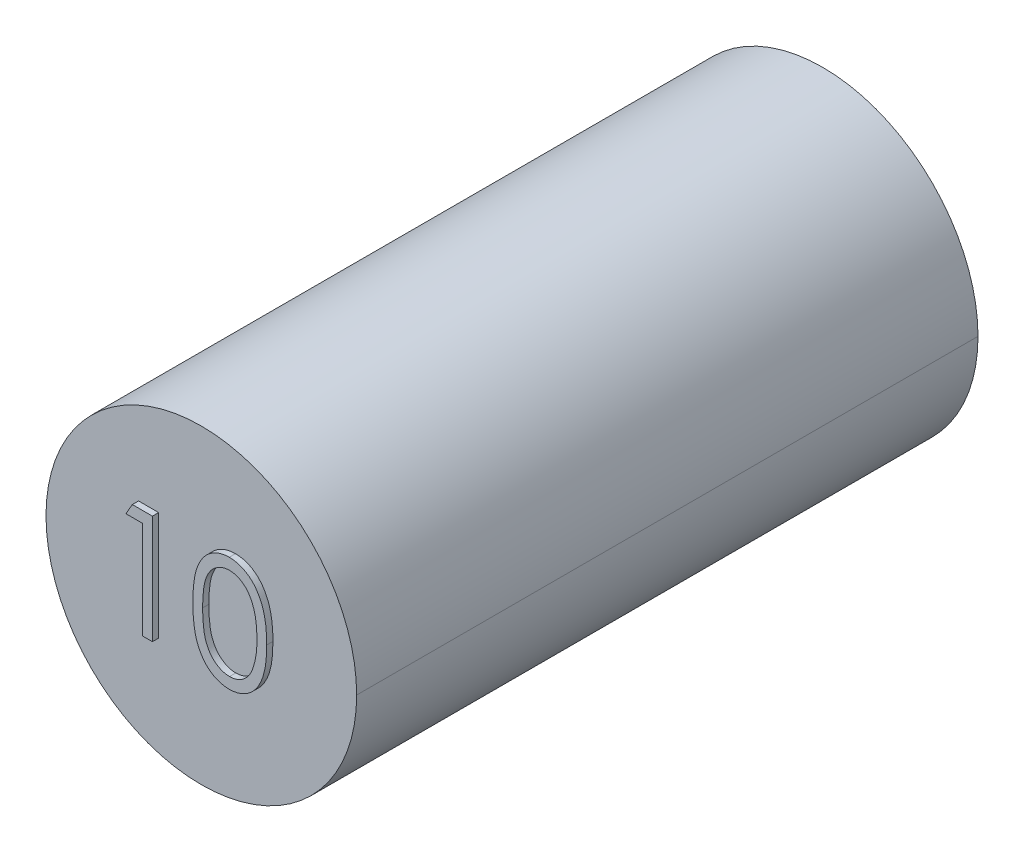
ISO-10303-21;
HEADER;
FILE_DESCRIPTION(('STEP AP214'),'2;1');
FILE_NAME('part.step','',(''),(''),'','','');
FILE_SCHEMA(('AUTOMOTIVE_DESIGN { 1 0 10303 214 1 1 1 1 }'));
ENDSEC;
DATA;
#1=APPLICATION_CONTEXT('core data for automotive mechanical design processes');
#2=APPLICATION_PROTOCOL_DEFINITION('international standard','automotive_design',2000,#1);
#3=PRODUCT_CONTEXT('',#1,'mechanical');
#4=PRODUCT('Part','Part','',(#3));
#5=PRODUCT_RELATED_PRODUCT_CATEGORY('part','',(#4));
#6=PRODUCT_DEFINITION_FORMATION('','',#4);
#7=PRODUCT_DEFINITION_CONTEXT('part definition',#1,'design');
#8=PRODUCT_DEFINITION('design','',#6,#7);
#9=PRODUCT_DEFINITION_SHAPE('','',#8);
#10=(LENGTH_UNIT() NAMED_UNIT(*) SI_UNIT(.MILLI.,.METRE.));
#11=(NAMED_UNIT(*) PLANE_ANGLE_UNIT() SI_UNIT($,.RADIAN.));
#12=(NAMED_UNIT(*) SI_UNIT($,.STERADIAN.) SOLID_ANGLE_UNIT());
#13=UNCERTAINTY_MEASURE_WITH_UNIT(LENGTH_MEASURE(1.E-05),#10,'distance_accuracy_value','');
#14=(GEOMETRIC_REPRESENTATION_CONTEXT(3) GLOBAL_UNCERTAINTY_ASSIGNED_CONTEXT((#13)) GLOBAL_UNIT_ASSIGNED_CONTEXT((#10,
#11,#12)) REPRESENTATION_CONTEXT('',''));
#15=CARTESIAN_POINT('',(0.,0.,0.));
#16=DIRECTION('',(0.,0.,1.));
#17=DIRECTION('',(1.,0.,0.));
#18=AXIS2_PLACEMENT_3D('',#15,#16,#17);
#19=CARTESIAN_POINT('',(0.,0.,0.));
#20=DIRECTION('',(0.,0.,1.));
#21=DIRECTION('',(1.,0.,0.));
#22=AXIS2_PLACEMENT_3D('',#19,#20,#21);
#23=PLANE('',#22);
#24=CARTESIAN_POINT('',(1.10761217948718,1.63076923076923,0.));
#25=CARTESIAN_POINT('',(1.06890158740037,1.62873778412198,0.));
#26=CARTESIAN_POINT('',(0.991409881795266,1.624671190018,0.));
#27=CARTESIAN_POINT('',(0.876961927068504,1.59597793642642,0.));
#28=CARTESIAN_POINT('',(0.76725757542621,1.5459649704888,0.));
#29=CARTESIAN_POINT('',(0.680014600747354,1.49101259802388,0.));
#30=CARTESIAN_POINT('',(0.613150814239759,1.43867428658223,0.));
#31=CARTESIAN_POINT('',(0.566068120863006,1.39328783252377,0.));
#32=CARTESIAN_POINT('',(0.521921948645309,1.34364157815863,0.));
#33=CARTESIAN_POINT('',(0.481254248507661,1.28923966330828,0.));
#34=CARTESIAN_POINT('',(0.443164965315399,1.23077429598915,0.));
#35=CARTESIAN_POINT('',(0.408183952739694,1.16778553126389,0.));
#36=CARTESIAN_POINT('',(0.376666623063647,1.09995416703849,0.));
#37=CARTESIAN_POINT('',(0.347582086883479,1.02733773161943,0.));
#38=CARTESIAN_POINT('',(0.322009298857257,0.947756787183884,0.));
#39=CARTESIAN_POINT('',(0.30091533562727,0.859987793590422,0.));
#40=CARTESIAN_POINT('',(0.281428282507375,0.763525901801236,0.));
#41=CARTESIAN_POINT('',(0.267633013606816,0.657806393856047,0.));
#42=CARTESIAN_POINT('',(0.255369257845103,0.543524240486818,0.));
#43=CARTESIAN_POINT('',(0.247487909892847,0.420246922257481,0.));
#44=CARTESIAN_POINT('',(0.241356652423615,0.288182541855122,0.));
#45=CARTESIAN_POINT('',(0.241138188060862,0.196983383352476,0.));
#46=CARTESIAN_POINT('',(0.241025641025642,0.15,0.));
#47=(BOUNDED_CURVE() B_SPLINE_CURVE(3,(#24,#25,#26,#27,#28,#29,#30,#31,#32,#33,#34,#35,#36,#37,
#38,#39,#40,#41,#42,#43,#44,#45,#46),.UNSPECIFIED.,.F.,.F.) B_SPLINE_CURVE_WITH_KNOTS((4,1,1,1,
1,1,1,1,1,1,1,1,1,1,1,1,1,1,1,1,4),(0.,0.0603866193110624,0.120883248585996,0.18275461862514,
0.247811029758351,0.281299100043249,0.315087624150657,0.349702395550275,0.384856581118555,
0.420966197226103,0.458511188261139,0.497174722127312,0.53760204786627,0.580503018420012,
0.627467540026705,0.678388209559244,0.733983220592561,0.793746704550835,0.857713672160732,
0.926697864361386,1.),
.UNSPECIFIED.) CURVE() GEOMETRIC_REPRESENTATION_ITEM() RATIONAL_B_SPLINE_CURVE((1.,1.,1.,1.,1.,
1.,1.,1.,1.,1.,1.,1.,1.,1.,1.,1.,1.,1.,1.,1.,1.,1.,1.)) REPRESENTATION_ITEM(''));
#48=CARTESIAN_POINT('',(1.10761217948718,1.63076923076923,0.));
#49=VERTEX_POINT('',#48);
#50=CARTESIAN_POINT('',(0.241025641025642,0.15,0.));
#51=VERTEX_POINT('',#50);
#52=EDGE_CURVE('E328',#49,#51,#47,.T.);
#53=ORIENTED_EDGE('',*,*,#52,.T.);
#54=CARTESIAN_POINT('',(0.241025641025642,0.15,0.));
#55=CARTESIAN_POINT('',(0.241145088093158,0.103251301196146,0.));
#56=CARTESIAN_POINT('',(0.241376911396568,0.0125212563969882,0.));
#57=CARTESIAN_POINT('',(0.247433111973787,-0.119322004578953,0.));
#58=CARTESIAN_POINT('',(0.255683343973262,-0.24229233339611,0.));
#59=CARTESIAN_POINT('',(0.266324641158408,-0.356545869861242,0.));
#60=CARTESIAN_POINT('',(0.282127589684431,-0.461695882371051,0.));
#61=CARTESIAN_POINT('',(0.299834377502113,-0.558465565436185,0.));
#62=CARTESIAN_POINT('',(0.321382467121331,-0.646342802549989,0.));
#63=CARTESIAN_POINT('',(0.346877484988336,-0.725930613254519,0.));
#64=CARTESIAN_POINT('',(0.375916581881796,-0.798579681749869,0.));
#65=CARTESIAN_POINT('',(0.407622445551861,-0.866180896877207,0.));
#66=CARTESIAN_POINT('',(0.441683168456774,-0.929532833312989,0.));
#67=CARTESIAN_POINT('',(0.479802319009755,-0.988066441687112,0.));
#68=CARTESIAN_POINT('',(0.521317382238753,-1.04197260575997,0.));
#69=CARTESIAN_POINT('',(0.565290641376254,-1.09220543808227,0.));
#70=CARTESIAN_POINT('',(0.613363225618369,-1.13700241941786,0.));
#71=CARTESIAN_POINT('',(0.679866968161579,-1.19072927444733,0.));
#72=CARTESIAN_POINT('',(0.767663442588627,-1.24624840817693,0.));
#73=CARTESIAN_POINT('',(0.878283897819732,-1.29459449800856,0.));
#74=CARTESIAN_POINT('',(0.991952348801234,-1.32497695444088,0.));
#75=CARTESIAN_POINT('',(1.06910359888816,-1.328840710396,0.));
#76=CARTESIAN_POINT('',(1.10761217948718,-1.33076923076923,0.));
#77=(BOUNDED_CURVE() B_SPLINE_CURVE(3,(#54,#55,#56,#57,#58,#59,#60,#61,#62,#63,#64,#65,#66,#67,
#68,#69,#70,#71,#72,#73,#74,#75,#76),.UNSPECIFIED.,.F.,.F.) B_SPLINE_CURVE_WITH_KNOTS((4,1,1,1,
1,1,1,1,1,1,1,1,1,1,1,1,1,1,1,1,4),(0.,0.0729510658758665,0.141583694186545,0.205926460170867,
0.265301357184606,0.320597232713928,0.371816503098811,0.418789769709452,0.461698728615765,
0.502133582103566,0.540804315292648,0.578180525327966,0.614296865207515,0.649678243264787,
0.684299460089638,0.718358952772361,0.752080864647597,0.817652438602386,0.879722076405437,
0.939965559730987,1.),
.UNSPECIFIED.) CURVE() GEOMETRIC_REPRESENTATION_ITEM() RATIONAL_B_SPLINE_CURVE((1.,1.,1.,1.,1.,
1.,1.,1.,1.,1.,1.,1.,1.,1.,1.,1.,1.,1.,1.,1.,1.,1.,1.)) REPRESENTATION_ITEM(''));
#78=CARTESIAN_POINT('',(1.10761217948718,-1.33076923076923,0.));
#79=VERTEX_POINT('',#78);
#80=EDGE_CURVE('E424',#51,#79,#77,.T.);
#81=ORIENTED_EDGE('',*,*,#80,.T.);
#82=CARTESIAN_POINT('',(1.10761217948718,-1.33076923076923,0.));
#83=CARTESIAN_POINT('',(1.14636985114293,-1.32917144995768,0.));
#84=CARTESIAN_POINT('',(1.22380517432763,-1.32597918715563,0.));
#85=CARTESIAN_POINT('',(1.33693896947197,-1.29518044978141,0.));
#86=CARTESIAN_POINT('',(1.44676923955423,-1.24871091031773,0.));
#87=CARTESIAN_POINT('',(1.53284117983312,-1.19376340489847,0.));
#88=CARTESIAN_POINT('',(1.59832372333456,-1.14143507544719,0.));
#89=CARTESIAN_POINT('',(1.64524071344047,-1.09682042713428,0.));
#90=CARTESIAN_POINT('',(1.68830276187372,-1.04686455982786,0.));
#91=CARTESIAN_POINT('',(1.72914483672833,-0.992965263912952,0.));
#92=CARTESIAN_POINT('',(1.76660391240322,-0.934092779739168,0.));
#93=CARTESIAN_POINT('',(1.80066705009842,-0.870530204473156,0.));
#94=CARTESIAN_POINT('',(1.83175039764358,-0.802101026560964,0.));
#95=CARTESIAN_POINT('',(1.84945944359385,-0.754331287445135,0.));
#96=CARTESIAN_POINT('',(1.85851362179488,-0.729907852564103,0.));
#97=(BOUNDED_CURVE() B_SPLINE_CURVE(3,(#82,#83,#84,#85,#86,#87,#88,#89,#90,#91,#92,#93,#94,#95,
#96),.UNSPECIFIED.,.F.,.F.) B_SPLINE_CURVE_WITH_KNOTS((4,1,1,1,1,1,1,1,1,1,1,1,4),(0.,
0.112813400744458,0.225393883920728,0.339594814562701,0.459675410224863,0.521735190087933,
0.583925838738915,0.648174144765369,0.713881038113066,0.781004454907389,0.851450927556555,
0.924050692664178,1.),
.UNSPECIFIED.) CURVE() GEOMETRIC_REPRESENTATION_ITEM() RATIONAL_B_SPLINE_CURVE((1.,1.,1.,1.,1.,
1.,1.,1.,1.,1.,1.,1.,1.,1.,1.)) REPRESENTATION_ITEM(''));
#98=CARTESIAN_POINT('',(1.85851362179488,-0.729907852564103,0.));
#99=VERTEX_POINT('',#98);
#100=EDGE_CURVE('E437',#79,#99,#97,.T.);
#101=ORIENTED_EDGE('',*,*,#100,.T.);
#102=CARTESIAN_POINT('',(1.85851362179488,-0.729907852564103,0.));
#103=CARTESIAN_POINT('',(1.86906538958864,-0.698678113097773,0.));
#104=CARTESIAN_POINT('',(1.8904900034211,-0.63526834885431,0.));
#105=CARTESIAN_POINT('',(1.91810177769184,-0.53690469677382,0.));
#106=CARTESIAN_POINT('',(1.93984717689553,-0.433701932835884,0.));
#107=CARTESIAN_POINT('',(1.95941054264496,-0.326276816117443,0.));
#108=CARTESIAN_POINT('',(1.97276359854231,-0.213837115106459,0.));
#109=CARTESIAN_POINT('',(1.98351141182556,-0.0967307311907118,0.));
#110=CARTESIAN_POINT('',(1.98984209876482,0.0251306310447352,0.));
#111=CARTESIAN_POINT('',(1.99062684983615,0.107925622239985,0.));
#112=CARTESIAN_POINT('',(1.99102564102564,0.15,0.));
#113=(BOUNDED_CURVE() B_SPLINE_CURVE(3,(#102,#103,#104,#105,#106,#107,#108,#109,#110,#111,#112),
.UNSPECIFIED.,.F.,.F.) B_SPLINE_CURVE_WITH_KNOTS((4,1,1,1,1,1,1,1,4),(0.,0.110588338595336,
0.224541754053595,0.342503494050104,0.464324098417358,0.590756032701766,0.722227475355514,
0.858842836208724,1.),
.UNSPECIFIED.) CURVE() GEOMETRIC_REPRESENTATION_ITEM() RATIONAL_B_SPLINE_CURVE((1.,1.,1.,1.,1.,
1.,1.,1.,1.,1.,1.)) REPRESENTATION_ITEM(''));
#114=CARTESIAN_POINT('',(1.99102564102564,0.15,0.));
#115=VERTEX_POINT('',#114);
#116=EDGE_CURVE('E43',#99,#115,#113,.T.);
#117=ORIENTED_EDGE('',*,*,#116,.T.);
#118=CARTESIAN_POINT('',(1.99102564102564,0.15,0.));
#119=CARTESIAN_POINT('',(1.99047545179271,0.192067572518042,0.));
#120=CARTESIAN_POINT('',(1.98939916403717,0.274360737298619,0.));
#121=CARTESIAN_POINT('',(1.98528517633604,0.394878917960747,0.));
#122=CARTESIAN_POINT('',(1.97466160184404,0.509346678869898,0.));
#123=CARTESIAN_POINT('',(1.96286248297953,0.618257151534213,0.));
#124=CARTESIAN_POINT('',(1.94546526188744,0.721007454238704,0.));
#125=CARTESIAN_POINT('',(1.92670745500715,0.81845775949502,0.));
#126=CARTESIAN_POINT('',(1.90150624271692,0.909400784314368,0.));
#127=CARTESIAN_POINT('',(1.87458646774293,0.995260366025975,0.));
#128=CARTESIAN_POINT('',(1.8437760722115,1.07506102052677,0.));
#129=CARTESIAN_POINT('',(1.80986033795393,1.14917480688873,0.));
#130=CARTESIAN_POINT('',(1.77363857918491,1.21795953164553,0.));
#131=CARTESIAN_POINT('',(1.73429633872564,1.28122647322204,0.));
#132=CARTESIAN_POINT('',(1.69230065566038,1.33925901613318,0.));
#133=CARTESIAN_POINT('',(1.64654310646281,1.39089361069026,0.));
#134=CARTESIAN_POINT('',(1.59883873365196,1.4377305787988,0.));
#135=CARTESIAN_POINT('',(1.53202154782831,1.49119314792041,0.));
#136=CARTESIAN_POINT('',(1.44454725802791,1.54570484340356,0.));
#137=CARTESIAN_POINT('',(1.33570161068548,1.5958706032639,0.));
#138=CARTESIAN_POINT('',(1.22243096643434,1.62467889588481,0.));
#139=CARTESIAN_POINT('',(1.14585751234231,1.62874058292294,0.));
#140=CARTESIAN_POINT('',(1.10761217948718,1.63076923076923,0.));
#141=(BOUNDED_CURVE() B_SPLINE_CURVE(3,(#118,#119,#120,#121,#122,#123,#124,#125,#126,#127,#128,
#129,#130,#131,#132,#133,#134,#135,#136,#137,#138,#139,#140),.UNSPECIFIED.,.F.,
.F.) B_SPLINE_CURVE_WITH_KNOTS((4,1,1,1,1,1,1,1,1,1,1,1,1,1,1,1,1,1,1,1,4),(0.,
0.0656811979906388,0.128486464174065,0.188175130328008,0.245106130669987,0.299448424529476,
0.350822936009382,0.399941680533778,0.446671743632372,0.491254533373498,0.533376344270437,
0.573852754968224,0.612526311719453,0.649597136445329,0.68553204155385,0.720105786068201,
0.75383766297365,0.818925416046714,0.880493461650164,0.940311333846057,1.),
.UNSPECIFIED.) CURVE() GEOMETRIC_REPRESENTATION_ITEM() RATIONAL_B_SPLINE_CURVE((1.,1.,1.,1.,1.,
1.,1.,1.,1.,1.,1.,1.,1.,1.,1.,1.,1.,1.,1.,1.,1.,1.,1.)) REPRESENTATION_ITEM(''));
#142=EDGE_CURVE('E9',#115,#49,#141,.T.);
#143=ORIENTED_EDGE('',*,*,#142,.T.);
#144=EDGE_LOOP('',(#53,#81,#101,#117,#143));
#145=FACE_BOUND('',#144,.T.);
#146=ADVANCED_FACE('F15',(#145),#23,.T.);
#147=CARTESIAN_POINT('',(1.99102564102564,0.15,0.2));
#148=CARTESIAN_POINT('',(1.99102564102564,0.15,0.));
#149=CARTESIAN_POINT('',(1.99047545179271,0.192067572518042,0.2));
#150=CARTESIAN_POINT('',(1.99047545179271,0.192067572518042,0.));
#151=CARTESIAN_POINT('',(1.98939916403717,0.274360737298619,0.2));
#152=CARTESIAN_POINT('',(1.98939916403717,0.274360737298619,0.));
#153=CARTESIAN_POINT('',(1.98528517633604,0.394878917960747,0.2));
#154=CARTESIAN_POINT('',(1.98528517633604,0.394878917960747,0.));
#155=CARTESIAN_POINT('',(1.97466160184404,0.509346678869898,0.2));
#156=CARTESIAN_POINT('',(1.97466160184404,0.509346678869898,0.));
#157=CARTESIAN_POINT('',(1.96286248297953,0.618257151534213,0.2));
#158=CARTESIAN_POINT('',(1.96286248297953,0.618257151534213,0.));
#159=CARTESIAN_POINT('',(1.94546526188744,0.721007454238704,0.2));
#160=CARTESIAN_POINT('',(1.94546526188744,0.721007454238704,0.));
#161=CARTESIAN_POINT('',(1.92670745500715,0.81845775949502,0.2));
#162=CARTESIAN_POINT('',(1.92670745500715,0.81845775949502,0.));
#163=CARTESIAN_POINT('',(1.90150624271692,0.909400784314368,0.2));
#164=CARTESIAN_POINT('',(1.90150624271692,0.909400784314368,0.));
#165=CARTESIAN_POINT('',(1.87458646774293,0.995260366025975,0.2));
#166=CARTESIAN_POINT('',(1.87458646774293,0.995260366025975,0.));
#167=CARTESIAN_POINT('',(1.8437760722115,1.07506102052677,0.2));
#168=CARTESIAN_POINT('',(1.8437760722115,1.07506102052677,0.));
#169=CARTESIAN_POINT('',(1.80986033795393,1.14917480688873,0.2));
#170=CARTESIAN_POINT('',(1.80986033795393,1.14917480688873,0.));
#171=CARTESIAN_POINT('',(1.77363857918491,1.21795953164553,0.2));
#172=CARTESIAN_POINT('',(1.77363857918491,1.21795953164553,0.));
#173=CARTESIAN_POINT('',(1.73429633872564,1.28122647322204,0.2));
#174=CARTESIAN_POINT('',(1.73429633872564,1.28122647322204,0.));
#175=CARTESIAN_POINT('',(1.69230065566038,1.33925901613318,0.2));
#176=CARTESIAN_POINT('',(1.69230065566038,1.33925901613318,0.));
#177=CARTESIAN_POINT('',(1.64654310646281,1.39089361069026,0.2));
#178=CARTESIAN_POINT('',(1.64654310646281,1.39089361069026,0.));
#179=CARTESIAN_POINT('',(1.59883873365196,1.4377305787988,0.2));
#180=CARTESIAN_POINT('',(1.59883873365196,1.4377305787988,0.));
#181=CARTESIAN_POINT('',(1.53202154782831,1.49119314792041,0.2));
#182=CARTESIAN_POINT('',(1.53202154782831,1.49119314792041,0.));
#183=CARTESIAN_POINT('',(1.44454725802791,1.54570484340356,0.2));
#184=CARTESIAN_POINT('',(1.44454725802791,1.54570484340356,0.));
#185=CARTESIAN_POINT('',(1.33570161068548,1.5958706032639,0.2));
#186=CARTESIAN_POINT('',(1.33570161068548,1.5958706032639,0.));
#187=CARTESIAN_POINT('',(1.22243096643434,1.62467889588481,0.2));
#188=CARTESIAN_POINT('',(1.22243096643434,1.62467889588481,0.));
#189=CARTESIAN_POINT('',(1.14585751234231,1.62874058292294,0.2));
#190=CARTESIAN_POINT('',(1.14585751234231,1.62874058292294,0.));
#191=CARTESIAN_POINT('',(1.10761217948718,1.63076923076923,0.2));
#192=CARTESIAN_POINT('',(1.10761217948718,1.63076923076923,0.));
#193=(BOUNDED_SURFACE() B_SPLINE_SURFACE(3,1,((#147,#148),(#149,#150),(#151,#152),(#153,#154),
(#155,#156),(#157,#158),(#159,#160),(#161,#162),(#163,#164),(#165,#166),(#167,#168),(#169,#170),
(#171,#172),(#173,#174),(#175,#176),(#177,#178),(#179,#180),(#181,#182),(#183,#184),(#185,#186),
(#187,#188),(#189,#190),(#191,#192)),.UNSPECIFIED.,.F.,.F.,.F.) B_SPLINE_SURFACE_WITH_KNOTS((4,
1,1,1,1,1,1,1,1,1,1,1,1,1,1,1,1,1,1,1,4),(2,2),(0.,0.0656811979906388,0.128486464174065,
0.188175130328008,0.245106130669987,0.299448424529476,0.350822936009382,0.399941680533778,
0.446671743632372,0.491254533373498,0.533376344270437,0.573852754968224,0.612526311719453,
0.649597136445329,0.68553204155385,0.720105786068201,0.75383766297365,0.818925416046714,
0.880493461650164,0.940311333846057,1.),(0.,1.),
.UNSPECIFIED.) GEOMETRIC_REPRESENTATION_ITEM() RATIONAL_B_SPLINE_SURFACE(((1.,1.),(1.,1.),(1.,
1.),(1.,1.),(1.,1.),(1.,1.),(1.,1.),(1.,1.),(1.,1.),(1.,1.),(1.,1.),(1.,1.),(1.,1.),(1.,1.),(1.,
1.),(1.,1.),(1.,1.),(1.,1.),(1.,1.),(1.,1.),(1.,1.),(1.,1.),(1.,1.))) REPRESENTATION_ITEM('') SURFACE());
#194=DIRECTION('',(0.,0.,-1.));
#195=VECTOR('',#194,1.);
#196=CARTESIAN_POINT('',(1.99102564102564,0.15,0.2));
#197=LINE('',#196,#195);
#198=CARTESIAN_POINT('',(1.99102564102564,0.15,0.2));
#199=VERTEX_POINT('',#198);
#200=EDGE_CURVE('E25',#199,#115,#197,.T.);
#201=CARTESIAN_POINT('',(1.99102564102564,0.15,0.2));
#202=CARTESIAN_POINT('',(1.99047545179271,0.192067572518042,0.2));
#203=CARTESIAN_POINT('',(1.98939916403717,0.274360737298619,0.2));
#204=CARTESIAN_POINT('',(1.98528517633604,0.394878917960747,0.2));
#205=CARTESIAN_POINT('',(1.97466160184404,0.509346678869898,0.2));
#206=CARTESIAN_POINT('',(1.96286248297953,0.618257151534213,0.2));
#207=CARTESIAN_POINT('',(1.94546526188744,0.721007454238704,0.2));
#208=CARTESIAN_POINT('',(1.92670745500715,0.81845775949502,0.2));
#209=CARTESIAN_POINT('',(1.90150624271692,0.909400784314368,0.2));
#210=CARTESIAN_POINT('',(1.87458646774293,0.995260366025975,0.2));
#211=CARTESIAN_POINT('',(1.8437760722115,1.07506102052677,0.2));
#212=CARTESIAN_POINT('',(1.80986033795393,1.14917480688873,0.2));
#213=CARTESIAN_POINT('',(1.77363857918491,1.21795953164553,0.2));
#214=CARTESIAN_POINT('',(1.73429633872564,1.28122647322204,0.2));
#215=CARTESIAN_POINT('',(1.69230065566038,1.33925901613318,0.2));
#216=CARTESIAN_POINT('',(1.64654310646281,1.39089361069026,0.2));
#217=CARTESIAN_POINT('',(1.59883873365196,1.4377305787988,0.2));
#218=CARTESIAN_POINT('',(1.53202154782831,1.49119314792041,0.2));
#219=CARTESIAN_POINT('',(1.44454725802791,1.54570484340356,0.2));
#220=CARTESIAN_POINT('',(1.33570161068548,1.5958706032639,0.2));
#221=CARTESIAN_POINT('',(1.22243096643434,1.62467889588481,0.2));
#222=CARTESIAN_POINT('',(1.14585751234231,1.62874058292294,0.2));
#223=CARTESIAN_POINT('',(1.10761217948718,1.63076923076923,0.2));
#224=(BOUNDED_CURVE() B_SPLINE_CURVE(3,(#201,#202,#203,#204,#205,#206,#207,#208,#209,#210,#211,
#212,#213,#214,#215,#216,#217,#218,#219,#220,#221,#222,#223),.UNSPECIFIED.,.F.,
.F.) B_SPLINE_CURVE_WITH_KNOTS((4,1,1,1,1,1,1,1,1,1,1,1,1,1,1,1,1,1,1,1,4),(0.,
0.0656811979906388,0.128486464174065,0.188175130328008,0.245106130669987,0.299448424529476,
0.350822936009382,0.399941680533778,0.446671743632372,0.491254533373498,0.533376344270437,
0.573852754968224,0.612526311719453,0.649597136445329,0.68553204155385,0.720105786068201,
0.75383766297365,0.818925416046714,0.880493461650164,0.940311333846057,1.),
.UNSPECIFIED.) CURVE() GEOMETRIC_REPRESENTATION_ITEM() RATIONAL_B_SPLINE_CURVE((1.,1.,1.,1.,1.,
1.,1.,1.,1.,1.,1.,1.,1.,1.,1.,1.,1.,1.,1.,1.,1.,1.,1.)) REPRESENTATION_ITEM(''));
#225=CARTESIAN_POINT('',(1.10761217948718,1.63076923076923,0.2));
#226=VERTEX_POINT('',#225);
#227=EDGE_CURVE('E275',#199,#226,#224,.T.);
#228=DIRECTION('',(0.,0.,-1.));
#229=VECTOR('',#228,1.);
#230=CARTESIAN_POINT('',(1.10761217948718,1.63076923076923,0.2));
#231=LINE('',#230,#229);
#232=EDGE_CURVE('E414',#226,#49,#231,.T.);
#233=ORIENTED_EDGE('',*,*,#142,.F.);
#234=ORIENTED_EDGE('',*,*,#200,.F.);
#235=ORIENTED_EDGE('',*,*,#227,.T.);
#236=ORIENTED_EDGE('',*,*,#232,.T.);
#237=EDGE_LOOP('',(#233,#234,#235,#236));
#238=FACE_BOUND('',#237,.T.);
#239=ADVANCED_FACE('F463',(#238),#193,.T.);
#240=CARTESIAN_POINT('',(1.85851362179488,-0.729907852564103,0.2));
#241=CARTESIAN_POINT('',(1.85851362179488,-0.729907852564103,0.));
#242=CARTESIAN_POINT('',(1.86906538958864,-0.698678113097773,0.2));
#243=CARTESIAN_POINT('',(1.86906538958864,-0.698678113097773,0.));
#244=CARTESIAN_POINT('',(1.8904900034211,-0.63526834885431,0.2));
#245=CARTESIAN_POINT('',(1.8904900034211,-0.63526834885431,0.));
#246=CARTESIAN_POINT('',(1.91810177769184,-0.53690469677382,0.2));
#247=CARTESIAN_POINT('',(1.91810177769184,-0.53690469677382,0.));
#248=CARTESIAN_POINT('',(1.93984717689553,-0.433701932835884,0.2));
#249=CARTESIAN_POINT('',(1.93984717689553,-0.433701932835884,0.));
#250=CARTESIAN_POINT('',(1.95941054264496,-0.326276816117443,0.2));
#251=CARTESIAN_POINT('',(1.95941054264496,-0.326276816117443,0.));
#252=CARTESIAN_POINT('',(1.97276359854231,-0.213837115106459,0.2));
#253=CARTESIAN_POINT('',(1.97276359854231,-0.213837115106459,0.));
#254=CARTESIAN_POINT('',(1.98351141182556,-0.0967307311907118,0.2));
#255=CARTESIAN_POINT('',(1.98351141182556,-0.0967307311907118,0.));
#256=CARTESIAN_POINT('',(1.98984209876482,0.0251306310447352,0.2));
#257=CARTESIAN_POINT('',(1.98984209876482,0.0251306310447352,0.));
#258=CARTESIAN_POINT('',(1.99062684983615,0.107925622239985,0.2));
#259=CARTESIAN_POINT('',(1.99062684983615,0.107925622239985,0.));
#260=CARTESIAN_POINT('',(1.99102564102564,0.15,0.2));
#261=CARTESIAN_POINT('',(1.99102564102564,0.15,0.));
#262=(BOUNDED_SURFACE() B_SPLINE_SURFACE(3,1,((#240,#241),(#242,#243),(#244,#245),(#246,#247),
(#248,#249),(#250,#251),(#252,#253),(#254,#255),(#256,#257),(#258,#259),(#260,#261)),
.UNSPECIFIED.,.F.,.F.,.F.) B_SPLINE_SURFACE_WITH_KNOTS((4,1,1,1,1,1,1,1,4),(2,2),(0.,
0.110588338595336,0.224541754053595,0.342503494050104,0.464324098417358,0.590756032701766,
0.722227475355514,0.858842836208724,1.),(0.,1.),
.UNSPECIFIED.) GEOMETRIC_REPRESENTATION_ITEM() RATIONAL_B_SPLINE_SURFACE(((1.,1.),(1.,1.),(1.,
1.),(1.,1.),(1.,1.),(1.,1.),(1.,1.),(1.,1.),(1.,1.),(1.,1.),(1.,1.))) REPRESENTATION_ITEM('') SURFACE());
#263=DIRECTION('',(0.,0.,-1.));
#264=VECTOR('',#263,1.);
#265=CARTESIAN_POINT('',(1.85851362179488,-0.729907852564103,0.2));
#266=LINE('',#265,#264);
#267=CARTESIAN_POINT('',(1.85851362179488,-0.729907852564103,0.2));
#268=VERTEX_POINT('',#267);
#269=EDGE_CURVE('E353',#268,#99,#266,.T.);
#270=CARTESIAN_POINT('',(1.85851362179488,-0.729907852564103,0.2));
#271=CARTESIAN_POINT('',(1.86906538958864,-0.698678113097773,0.2));
#272=CARTESIAN_POINT('',(1.8904900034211,-0.63526834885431,0.2));
#273=CARTESIAN_POINT('',(1.91810177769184,-0.53690469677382,0.2));
#274=CARTESIAN_POINT('',(1.93984717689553,-0.433701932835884,0.2));
#275=CARTESIAN_POINT('',(1.95941054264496,-0.326276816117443,0.2));
#276=CARTESIAN_POINT('',(1.97276359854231,-0.213837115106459,0.2));
#277=CARTESIAN_POINT('',(1.98351141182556,-0.0967307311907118,0.2));
#278=CARTESIAN_POINT('',(1.98984209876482,0.0251306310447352,0.2));
#279=CARTESIAN_POINT('',(1.99062684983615,0.107925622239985,0.2));
#280=CARTESIAN_POINT('',(1.99102564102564,0.15,0.2));
#281=(BOUNDED_CURVE() B_SPLINE_CURVE(3,(#270,#271,#272,#273,#274,#275,#276,#277,#278,#279,#280),
.UNSPECIFIED.,.F.,.F.) B_SPLINE_CURVE_WITH_KNOTS((4,1,1,1,1,1,1,1,4),(0.,0.110588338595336,
0.224541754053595,0.342503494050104,0.464324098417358,0.590756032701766,0.722227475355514,
0.858842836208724,1.),
.UNSPECIFIED.) CURVE() GEOMETRIC_REPRESENTATION_ITEM() RATIONAL_B_SPLINE_CURVE((1.,1.,1.,1.,1.,
1.,1.,1.,1.,1.,1.)) REPRESENTATION_ITEM(''));
#282=EDGE_CURVE('E385',#268,#199,#281,.T.);
#283=ORIENTED_EDGE('',*,*,#116,.F.);
#284=ORIENTED_EDGE('',*,*,#269,.F.);
#285=ORIENTED_EDGE('',*,*,#282,.T.);
#286=ORIENTED_EDGE('',*,*,#200,.T.);
#287=EDGE_LOOP('',(#283,#284,#285,#286));
#288=FACE_BOUND('',#287,.T.);
#289=ADVANCED_FACE('F449',(#288),#262,.T.);
#290=CARTESIAN_POINT('',(1.10761217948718,-1.33076923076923,0.2));
#291=CARTESIAN_POINT('',(1.10761217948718,-1.33076923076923,0.));
#292=CARTESIAN_POINT('',(1.14636985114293,-1.32917144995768,0.2));
#293=CARTESIAN_POINT('',(1.14636985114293,-1.32917144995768,0.));
#294=CARTESIAN_POINT('',(1.22380517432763,-1.32597918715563,0.2));
#295=CARTESIAN_POINT('',(1.22380517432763,-1.32597918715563,0.));
#296=CARTESIAN_POINT('',(1.33693896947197,-1.29518044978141,0.2));
#297=CARTESIAN_POINT('',(1.33693896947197,-1.29518044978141,0.));
#298=CARTESIAN_POINT('',(1.44676923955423,-1.24871091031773,0.2));
#299=CARTESIAN_POINT('',(1.44676923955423,-1.24871091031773,0.));
#300=CARTESIAN_POINT('',(1.53284117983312,-1.19376340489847,0.2));
#301=CARTESIAN_POINT('',(1.53284117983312,-1.19376340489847,0.));
#302=CARTESIAN_POINT('',(1.59832372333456,-1.14143507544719,0.2));
#303=CARTESIAN_POINT('',(1.59832372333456,-1.14143507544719,0.));
#304=CARTESIAN_POINT('',(1.64524071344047,-1.09682042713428,0.2));
#305=CARTESIAN_POINT('',(1.64524071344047,-1.09682042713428,0.));
#306=CARTESIAN_POINT('',(1.68830276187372,-1.04686455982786,0.2));
#307=CARTESIAN_POINT('',(1.68830276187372,-1.04686455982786,0.));
#308=CARTESIAN_POINT('',(1.72914483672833,-0.992965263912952,0.2));
#309=CARTESIAN_POINT('',(1.72914483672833,-0.992965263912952,0.));
#310=CARTESIAN_POINT('',(1.76660391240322,-0.934092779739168,0.2));
#311=CARTESIAN_POINT('',(1.76660391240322,-0.934092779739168,0.));
#312=CARTESIAN_POINT('',(1.80066705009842,-0.870530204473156,0.2));
#313=CARTESIAN_POINT('',(1.80066705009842,-0.870530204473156,0.));
#314=CARTESIAN_POINT('',(1.83175039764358,-0.802101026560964,0.2));
#315=CARTESIAN_POINT('',(1.83175039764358,-0.802101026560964,0.));
#316=CARTESIAN_POINT('',(1.84945944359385,-0.754331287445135,0.2));
#317=CARTESIAN_POINT('',(1.84945944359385,-0.754331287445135,0.));
#318=CARTESIAN_POINT('',(1.85851362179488,-0.729907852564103,0.2));
#319=CARTESIAN_POINT('',(1.85851362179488,-0.729907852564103,0.));
#320=(BOUNDED_SURFACE() B_SPLINE_SURFACE(3,1,((#290,#291),(#292,#293),(#294,#295),(#296,#297),
(#298,#299),(#300,#301),(#302,#303),(#304,#305),(#306,#307),(#308,#309),(#310,#311),(#312,#313),
(#314,#315),(#316,#317),(#318,#319)),.UNSPECIFIED.,.F.,.F.,.F.) B_SPLINE_SURFACE_WITH_KNOTS((4,
1,1,1,1,1,1,1,1,1,1,1,4),(2,2),(0.,0.112813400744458,0.225393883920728,0.339594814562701,
0.459675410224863,0.521735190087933,0.583925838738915,0.648174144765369,0.713881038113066,
0.781004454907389,0.851450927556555,0.924050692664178,1.),(0.,1.),
.UNSPECIFIED.) GEOMETRIC_REPRESENTATION_ITEM() RATIONAL_B_SPLINE_SURFACE(((1.,1.),(1.,1.),(1.,
1.),(1.,1.),(1.,1.),(1.,1.),(1.,1.),(1.,1.),(1.,1.),(1.,1.),(1.,1.),(1.,1.),(1.,1.),(1.,1.),(1.,1.))) REPRESENTATION_ITEM('') SURFACE());
#321=DIRECTION('',(0.,0.,-1.));
#322=VECTOR('',#321,1.);
#323=CARTESIAN_POINT('',(1.10761217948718,-1.33076923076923,0.2));
#324=LINE('',#323,#322);
#325=CARTESIAN_POINT('',(1.10761217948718,-1.33076923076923,0.2));
#326=VERTEX_POINT('',#325);
#327=EDGE_CURVE('E430',#326,#79,#324,.T.);
#328=CARTESIAN_POINT('',(1.10761217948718,-1.33076923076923,0.2));
#329=CARTESIAN_POINT('',(1.14636985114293,-1.32917144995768,0.2));
#330=CARTESIAN_POINT('',(1.22380517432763,-1.32597918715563,0.2));
#331=CARTESIAN_POINT('',(1.33693896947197,-1.29518044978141,0.2));
#332=CARTESIAN_POINT('',(1.44676923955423,-1.24871091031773,0.2));
#333=CARTESIAN_POINT('',(1.53284117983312,-1.19376340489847,0.2));
#334=CARTESIAN_POINT('',(1.59832372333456,-1.14143507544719,0.2));
#335=CARTESIAN_POINT('',(1.64524071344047,-1.09682042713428,0.2));
#336=CARTESIAN_POINT('',(1.68830276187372,-1.04686455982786,0.2));
#337=CARTESIAN_POINT('',(1.72914483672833,-0.992965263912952,0.2));
#338=CARTESIAN_POINT('',(1.76660391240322,-0.934092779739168,0.2));
#339=CARTESIAN_POINT('',(1.80066705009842,-0.870530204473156,0.2));
#340=CARTESIAN_POINT('',(1.83175039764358,-0.802101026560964,0.2));
#341=CARTESIAN_POINT('',(1.84945944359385,-0.754331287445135,0.2));
#342=CARTESIAN_POINT('',(1.85851362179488,-0.729907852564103,0.2));
#343=(BOUNDED_CURVE() B_SPLINE_CURVE(3,(#328,#329,#330,#331,#332,#333,#334,#335,#336,#337,#338,
#339,#340,#341,#342),.UNSPECIFIED.,.F.,.F.) B_SPLINE_CURVE_WITH_KNOTS((4,1,1,1,1,1,1,1,1,1,1,1,
4),(0.,0.112813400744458,0.225393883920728,0.339594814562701,0.459675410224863,
0.521735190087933,0.583925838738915,0.648174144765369,0.713881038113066,0.781004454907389,
0.851450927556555,0.924050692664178,1.),
.UNSPECIFIED.) CURVE() GEOMETRIC_REPRESENTATION_ITEM() RATIONAL_B_SPLINE_CURVE((1.,1.,1.,1.,1.,
1.,1.,1.,1.,1.,1.,1.,1.,1.,1.)) REPRESENTATION_ITEM(''));
#344=EDGE_CURVE('E318',#326,#268,#343,.T.);
#345=ORIENTED_EDGE('',*,*,#100,.F.);
#346=ORIENTED_EDGE('',*,*,#327,.F.);
#347=ORIENTED_EDGE('',*,*,#344,.T.);
#348=ORIENTED_EDGE('',*,*,#269,.T.);
#349=EDGE_LOOP('',(#345,#346,#347,#348));
#350=FACE_BOUND('',#349,.T.);
#351=ADVANCED_FACE('F454',(#350),#320,.T.);
#352=CARTESIAN_POINT('',(0.241025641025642,0.15,0.2));
#353=CARTESIAN_POINT('',(0.241025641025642,0.15,0.));
#354=CARTESIAN_POINT('',(0.241145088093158,0.103251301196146,0.2));
#355=CARTESIAN_POINT('',(0.241145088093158,0.103251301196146,0.));
#356=CARTESIAN_POINT('',(0.241376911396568,0.0125212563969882,0.2));
#357=CARTESIAN_POINT('',(0.241376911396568,0.0125212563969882,0.));
#358=CARTESIAN_POINT('',(0.247433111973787,-0.119322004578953,0.2));
#359=CARTESIAN_POINT('',(0.247433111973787,-0.119322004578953,0.));
#360=CARTESIAN_POINT('',(0.255683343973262,-0.24229233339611,0.2));
#361=CARTESIAN_POINT('',(0.255683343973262,-0.24229233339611,0.));
#362=CARTESIAN_POINT('',(0.266324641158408,-0.356545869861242,0.2));
#363=CARTESIAN_POINT('',(0.266324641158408,-0.356545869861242,0.));
#364=CARTESIAN_POINT('',(0.282127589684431,-0.461695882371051,0.2));
#365=CARTESIAN_POINT('',(0.282127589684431,-0.461695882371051,0.));
#366=CARTESIAN_POINT('',(0.299834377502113,-0.558465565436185,0.2));
#367=CARTESIAN_POINT('',(0.299834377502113,-0.558465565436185,0.));
#368=CARTESIAN_POINT('',(0.321382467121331,-0.646342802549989,0.2));
#369=CARTESIAN_POINT('',(0.321382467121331,-0.646342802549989,0.));
#370=CARTESIAN_POINT('',(0.346877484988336,-0.725930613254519,0.2));
#371=CARTESIAN_POINT('',(0.346877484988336,-0.725930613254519,0.));
#372=CARTESIAN_POINT('',(0.375916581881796,-0.798579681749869,0.2));
#373=CARTESIAN_POINT('',(0.375916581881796,-0.798579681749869,0.));
#374=CARTESIAN_POINT('',(0.407622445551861,-0.866180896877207,0.2));
#375=CARTESIAN_POINT('',(0.407622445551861,-0.866180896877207,0.));
#376=CARTESIAN_POINT('',(0.441683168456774,-0.929532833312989,0.2));
#377=CARTESIAN_POINT('',(0.441683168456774,-0.929532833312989,0.));
#378=CARTESIAN_POINT('',(0.479802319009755,-0.988066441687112,0.2));
#379=CARTESIAN_POINT('',(0.479802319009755,-0.988066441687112,0.));
#380=CARTESIAN_POINT('',(0.521317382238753,-1.04197260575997,0.2));
#381=CARTESIAN_POINT('',(0.521317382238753,-1.04197260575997,0.));
#382=CARTESIAN_POINT('',(0.565290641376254,-1.09220543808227,0.2));
#383=CARTESIAN_POINT('',(0.565290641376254,-1.09220543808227,0.));
#384=CARTESIAN_POINT('',(0.613363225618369,-1.13700241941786,0.2));
#385=CARTESIAN_POINT('',(0.613363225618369,-1.13700241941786,0.));
#386=CARTESIAN_POINT('',(0.679866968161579,-1.19072927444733,0.2));
#387=CARTESIAN_POINT('',(0.679866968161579,-1.19072927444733,0.));
#388=CARTESIAN_POINT('',(0.767663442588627,-1.24624840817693,0.2));
#389=CARTESIAN_POINT('',(0.767663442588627,-1.24624840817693,0.));
#390=CARTESIAN_POINT('',(0.878283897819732,-1.29459449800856,0.2));
#391=CARTESIAN_POINT('',(0.878283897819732,-1.29459449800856,0.));
#392=CARTESIAN_POINT('',(0.991952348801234,-1.32497695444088,0.2));
#393=CARTESIAN_POINT('',(0.991952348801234,-1.32497695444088,0.));
#394=CARTESIAN_POINT('',(1.06910359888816,-1.328840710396,0.2));
#395=CARTESIAN_POINT('',(1.06910359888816,-1.328840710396,0.));
#396=CARTESIAN_POINT('',(1.10761217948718,-1.33076923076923,0.2));
#397=CARTESIAN_POINT('',(1.10761217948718,-1.33076923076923,0.));
#398=(BOUNDED_SURFACE() B_SPLINE_SURFACE(3,1,((#352,#353),(#354,#355),(#356,#357),(#358,#359),
(#360,#361),(#362,#363),(#364,#365),(#366,#367),(#368,#369),(#370,#371),(#372,#373),(#374,#375),
(#376,#377),(#378,#379),(#380,#381),(#382,#383),(#384,#385),(#386,#387),(#388,#389),(#390,#391),
(#392,#393),(#394,#395),(#396,#397)),.UNSPECIFIED.,.F.,.F.,.F.) B_SPLINE_SURFACE_WITH_KNOTS((4,
1,1,1,1,1,1,1,1,1,1,1,1,1,1,1,1,1,1,1,4),(2,2),(0.,0.0729510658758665,0.141583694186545,
0.205926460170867,0.265301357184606,0.320597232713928,0.371816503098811,0.418789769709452,
0.461698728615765,0.502133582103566,0.540804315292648,0.578180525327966,0.614296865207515,
0.649678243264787,0.684299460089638,0.718358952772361,0.752080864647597,0.817652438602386,
0.879722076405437,0.939965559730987,1.),(0.,1.),
.UNSPECIFIED.) GEOMETRIC_REPRESENTATION_ITEM() RATIONAL_B_SPLINE_SURFACE(((1.,1.),(1.,1.),(1.,
1.),(1.,1.),(1.,1.),(1.,1.),(1.,1.),(1.,1.),(1.,1.),(1.,1.),(1.,1.),(1.,1.),(1.,1.),(1.,1.),(1.,
1.),(1.,1.),(1.,1.),(1.,1.),(1.,1.),(1.,1.),(1.,1.),(1.,1.),(1.,1.))) REPRESENTATION_ITEM('') SURFACE());
#399=DIRECTION('',(0.,0.,-1.));
#400=VECTOR('',#399,1.);
#401=CARTESIAN_POINT('',(0.241025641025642,0.15,0.2));
#402=LINE('',#401,#400);
#403=CARTESIAN_POINT('',(0.241025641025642,0.15,0.2));
#404=VERTEX_POINT('',#403);
#405=EDGE_CURVE('E420',#404,#51,#402,.T.);
#406=CARTESIAN_POINT('',(0.241025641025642,0.15,0.2));
#407=CARTESIAN_POINT('',(0.241145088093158,0.103251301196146,0.2));
#408=CARTESIAN_POINT('',(0.241376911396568,0.0125212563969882,0.2));
#409=CARTESIAN_POINT('',(0.247433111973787,-0.119322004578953,0.2));
#410=CARTESIAN_POINT('',(0.255683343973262,-0.24229233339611,0.2));
#411=CARTESIAN_POINT('',(0.266324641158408,-0.356545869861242,0.2));
#412=CARTESIAN_POINT('',(0.282127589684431,-0.461695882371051,0.2));
#413=CARTESIAN_POINT('',(0.299834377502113,-0.558465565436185,0.2));
#414=CARTESIAN_POINT('',(0.321382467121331,-0.646342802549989,0.2));
#415=CARTESIAN_POINT('',(0.346877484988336,-0.725930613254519,0.2));
#416=CARTESIAN_POINT('',(0.375916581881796,-0.798579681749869,0.2));
#417=CARTESIAN_POINT('',(0.407622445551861,-0.866180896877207,0.2));
#418=CARTESIAN_POINT('',(0.441683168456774,-0.929532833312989,0.2));
#419=CARTESIAN_POINT('',(0.479802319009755,-0.988066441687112,0.2));
#420=CARTESIAN_POINT('',(0.521317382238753,-1.04197260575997,0.2));
#421=CARTESIAN_POINT('',(0.565290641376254,-1.09220543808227,0.2));
#422=CARTESIAN_POINT('',(0.613363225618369,-1.13700241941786,0.2));
#423=CARTESIAN_POINT('',(0.679866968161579,-1.19072927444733,0.2));
#424=CARTESIAN_POINT('',(0.767663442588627,-1.24624840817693,0.2));
#425=CARTESIAN_POINT('',(0.878283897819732,-1.29459449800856,0.2));
#426=CARTESIAN_POINT('',(0.991952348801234,-1.32497695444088,0.2));
#427=CARTESIAN_POINT('',(1.06910359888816,-1.328840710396,0.2));
#428=CARTESIAN_POINT('',(1.10761217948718,-1.33076923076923,0.2));
#429=(BOUNDED_CURVE() B_SPLINE_CURVE(3,(#406,#407,#408,#409,#410,#411,#412,#413,#414,#415,#416,
#417,#418,#419,#420,#421,#422,#423,#424,#425,#426,#427,#428),.UNSPECIFIED.,.F.,
.F.) B_SPLINE_CURVE_WITH_KNOTS((4,1,1,1,1,1,1,1,1,1,1,1,1,1,1,1,1,1,1,1,4),(0.,
0.0729510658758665,0.141583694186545,0.205926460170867,0.265301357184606,0.320597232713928,
0.371816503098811,0.418789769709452,0.461698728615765,0.502133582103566,0.540804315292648,
0.578180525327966,0.614296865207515,0.649678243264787,0.684299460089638,0.718358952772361,
0.752080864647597,0.817652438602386,0.879722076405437,0.939965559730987,1.),
.UNSPECIFIED.) CURVE() GEOMETRIC_REPRESENTATION_ITEM() RATIONAL_B_SPLINE_CURVE((1.,1.,1.,1.,1.,
1.,1.,1.,1.,1.,1.,1.,1.,1.,1.,1.,1.,1.,1.,1.,1.,1.,1.)) REPRESENTATION_ITEM(''));
#430=EDGE_CURVE('E258',#404,#326,#429,.T.);
#431=ORIENTED_EDGE('',*,*,#80,.F.);
#432=ORIENTED_EDGE('',*,*,#405,.F.);
#433=ORIENTED_EDGE('',*,*,#430,.T.);
#434=ORIENTED_EDGE('',*,*,#327,.T.);
#435=EDGE_LOOP('',(#431,#432,#433,#434));
#436=FACE_BOUND('',#435,.T.);
#437=ADVANCED_FACE('F457',(#436),#398,.T.);
#438=CARTESIAN_POINT('',(1.10761217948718,1.63076923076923,0.2));
#439=CARTESIAN_POINT('',(1.10761217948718,1.63076923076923,0.));
#440=CARTESIAN_POINT('',(1.06890158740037,1.62873778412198,0.2));
#441=CARTESIAN_POINT('',(1.06890158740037,1.62873778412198,0.));
#442=CARTESIAN_POINT('',(0.991409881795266,1.624671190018,0.2));
#443=CARTESIAN_POINT('',(0.991409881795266,1.624671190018,0.));
#444=CARTESIAN_POINT('',(0.876961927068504,1.59597793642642,0.2));
#445=CARTESIAN_POINT('',(0.876961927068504,1.59597793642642,0.));
#446=CARTESIAN_POINT('',(0.76725757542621,1.5459649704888,0.2));
#447=CARTESIAN_POINT('',(0.76725757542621,1.5459649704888,0.));
#448=CARTESIAN_POINT('',(0.680014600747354,1.49101259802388,0.2));
#449=CARTESIAN_POINT('',(0.680014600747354,1.49101259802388,0.));
#450=CARTESIAN_POINT('',(0.613150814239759,1.43867428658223,0.2));
#451=CARTESIAN_POINT('',(0.613150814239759,1.43867428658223,0.));
#452=CARTESIAN_POINT('',(0.566068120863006,1.39328783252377,0.2));
#453=CARTESIAN_POINT('',(0.566068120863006,1.39328783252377,0.));
#454=CARTESIAN_POINT('',(0.521921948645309,1.34364157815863,0.2));
#455=CARTESIAN_POINT('',(0.521921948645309,1.34364157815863,0.));
#456=CARTESIAN_POINT('',(0.481254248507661,1.28923966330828,0.2));
#457=CARTESIAN_POINT('',(0.481254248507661,1.28923966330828,0.));
#458=CARTESIAN_POINT('',(0.443164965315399,1.23077429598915,0.2));
#459=CARTESIAN_POINT('',(0.443164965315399,1.23077429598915,0.));
#460=CARTESIAN_POINT('',(0.408183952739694,1.16778553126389,0.2));
#461=CARTESIAN_POINT('',(0.408183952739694,1.16778553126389,0.));
#462=CARTESIAN_POINT('',(0.376666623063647,1.09995416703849,0.2));
#463=CARTESIAN_POINT('',(0.376666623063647,1.09995416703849,0.));
#464=CARTESIAN_POINT('',(0.347582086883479,1.02733773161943,0.2));
#465=CARTESIAN_POINT('',(0.347582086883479,1.02733773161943,0.));
#466=CARTESIAN_POINT('',(0.322009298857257,0.947756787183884,0.2));
#467=CARTESIAN_POINT('',(0.322009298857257,0.947756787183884,0.));
#468=CARTESIAN_POINT('',(0.30091533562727,0.859987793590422,0.2));
#469=CARTESIAN_POINT('',(0.30091533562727,0.859987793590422,0.));
#470=CARTESIAN_POINT('',(0.281428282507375,0.763525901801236,0.2));
#471=CARTESIAN_POINT('',(0.281428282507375,0.763525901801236,0.));
#472=CARTESIAN_POINT('',(0.267633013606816,0.657806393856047,0.2));
#473=CARTESIAN_POINT('',(0.267633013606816,0.657806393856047,0.));
#474=CARTESIAN_POINT('',(0.255369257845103,0.543524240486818,0.2));
#475=CARTESIAN_POINT('',(0.255369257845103,0.543524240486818,0.));
#476=CARTESIAN_POINT('',(0.247487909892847,0.420246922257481,0.2));
#477=CARTESIAN_POINT('',(0.247487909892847,0.420246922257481,0.));
#478=CARTESIAN_POINT('',(0.241356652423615,0.288182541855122,0.2));
#479=CARTESIAN_POINT('',(0.241356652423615,0.288182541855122,0.));
#480=CARTESIAN_POINT('',(0.241138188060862,0.196983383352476,0.2));
#481=CARTESIAN_POINT('',(0.241138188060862,0.196983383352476,0.));
#482=CARTESIAN_POINT('',(0.241025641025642,0.15,0.2));
#483=CARTESIAN_POINT('',(0.241025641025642,0.15,0.));
#484=(BOUNDED_SURFACE() B_SPLINE_SURFACE(3,1,((#438,#439),(#440,#441),(#442,#443),(#444,#445),
(#446,#447),(#448,#449),(#450,#451),(#452,#453),(#454,#455),(#456,#457),(#458,#459),(#460,#461),
(#462,#463),(#464,#465),(#466,#467),(#468,#469),(#470,#471),(#472,#473),(#474,#475),(#476,#477),
(#478,#479),(#480,#481),(#482,#483)),.UNSPECIFIED.,.F.,.F.,.F.) B_SPLINE_SURFACE_WITH_KNOTS((4,
1,1,1,1,1,1,1,1,1,1,1,1,1,1,1,1,1,1,1,4),(2,2),(0.,0.0603866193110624,0.120883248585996,
0.18275461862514,0.247811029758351,0.281299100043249,0.315087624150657,0.349702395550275,
0.384856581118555,0.420966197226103,0.458511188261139,0.497174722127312,0.53760204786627,
0.580503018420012,0.627467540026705,0.678388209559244,0.733983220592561,0.793746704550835,
0.857713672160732,0.926697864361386,1.),(0.,1.),
.UNSPECIFIED.) GEOMETRIC_REPRESENTATION_ITEM() RATIONAL_B_SPLINE_SURFACE(((1.,1.),(1.,1.),(1.,
1.),(1.,1.),(1.,1.),(1.,1.),(1.,1.),(1.,1.),(1.,1.),(1.,1.),(1.,1.),(1.,1.),(1.,1.),(1.,1.),(1.,
1.),(1.,1.),(1.,1.),(1.,1.),(1.,1.),(1.,1.),(1.,1.),(1.,1.),(1.,1.))) REPRESENTATION_ITEM('') SURFACE());
#485=CARTESIAN_POINT('',(1.10761217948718,1.63076923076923,0.2));
#486=CARTESIAN_POINT('',(1.06890158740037,1.62873778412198,0.2));
#487=CARTESIAN_POINT('',(0.991409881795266,1.624671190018,0.2));
#488=CARTESIAN_POINT('',(0.876961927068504,1.59597793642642,0.2));
#489=CARTESIAN_POINT('',(0.76725757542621,1.5459649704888,0.2));
#490=CARTESIAN_POINT('',(0.680014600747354,1.49101259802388,0.2));
#491=CARTESIAN_POINT('',(0.613150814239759,1.43867428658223,0.2));
#492=CARTESIAN_POINT('',(0.566068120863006,1.39328783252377,0.2));
#493=CARTESIAN_POINT('',(0.521921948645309,1.34364157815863,0.2));
#494=CARTESIAN_POINT('',(0.481254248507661,1.28923966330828,0.2));
#495=CARTESIAN_POINT('',(0.443164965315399,1.23077429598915,0.2));
#496=CARTESIAN_POINT('',(0.408183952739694,1.16778553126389,0.2));
#497=CARTESIAN_POINT('',(0.376666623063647,1.09995416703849,0.2));
#498=CARTESIAN_POINT('',(0.347582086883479,1.02733773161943,0.2));
#499=CARTESIAN_POINT('',(0.322009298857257,0.947756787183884,0.2));
#500=CARTESIAN_POINT('',(0.30091533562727,0.859987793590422,0.2));
#501=CARTESIAN_POINT('',(0.281428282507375,0.763525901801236,0.2));
#502=CARTESIAN_POINT('',(0.267633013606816,0.657806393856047,0.2));
#503=CARTESIAN_POINT('',(0.255369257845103,0.543524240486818,0.2));
#504=CARTESIAN_POINT('',(0.247487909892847,0.420246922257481,0.2));
#505=CARTESIAN_POINT('',(0.241356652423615,0.288182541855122,0.2));
#506=CARTESIAN_POINT('',(0.241138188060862,0.196983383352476,0.2));
#507=CARTESIAN_POINT('',(0.241025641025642,0.15,0.2));
#508=(BOUNDED_CURVE() B_SPLINE_CURVE(3,(#485,#486,#487,#488,#489,#490,#491,#492,#493,#494,#495,
#496,#497,#498,#499,#500,#501,#502,#503,#504,#505,#506,#507),.UNSPECIFIED.,.F.,
.F.) B_SPLINE_CURVE_WITH_KNOTS((4,1,1,1,1,1,1,1,1,1,1,1,1,1,1,1,1,1,1,1,4),(0.,
0.0603866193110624,0.120883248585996,0.18275461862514,0.247811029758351,0.281299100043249,
0.315087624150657,0.349702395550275,0.384856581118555,0.420966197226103,0.458511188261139,
0.497174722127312,0.53760204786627,0.580503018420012,0.627467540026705,0.678388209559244,
0.733983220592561,0.793746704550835,0.857713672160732,0.926697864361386,1.),
.UNSPECIFIED.) CURVE() GEOMETRIC_REPRESENTATION_ITEM() RATIONAL_B_SPLINE_CURVE((1.,1.,1.,1.,1.,
1.,1.,1.,1.,1.,1.,1.,1.,1.,1.,1.,1.,1.,1.,1.,1.,1.,1.)) REPRESENTATION_ITEM(''));
#509=EDGE_CURVE('E269',#226,#404,#508,.T.);
#510=ORIENTED_EDGE('',*,*,#52,.F.);
#511=ORIENTED_EDGE('',*,*,#232,.F.);
#512=ORIENTED_EDGE('',*,*,#509,.T.);
#513=ORIENTED_EDGE('',*,*,#405,.T.);
#514=EDGE_LOOP('',(#510,#511,#512,#513));
#515=FACE_BOUND('',#514,.T.);
#516=ADVANCED_FACE('F466',(#515),#484,.T.);
#517=CARTESIAN_POINT('',(-0.0730769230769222,0.148597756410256,0.2));
#518=CARTESIAN_POINT('',(-0.0730769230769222,0.148597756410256,0.));
#519=CARTESIAN_POINT('',(-0.0727489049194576,0.204695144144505,0.2));
#520=CARTESIAN_POINT('',(-0.0727489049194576,0.204695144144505,0.));
#521=CARTESIAN_POINT('',(-0.0721117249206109,0.313665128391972,0.2));
#522=CARTESIAN_POINT('',(-0.0721117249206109,0.313665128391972,0.));
#523=CARTESIAN_POINT('',(-0.0650233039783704,0.472449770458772,0.2));
#524=CARTESIAN_POINT('',(-0.0650233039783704,0.472449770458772,0.));
#525=CARTESIAN_POINT('',(-0.0532479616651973,0.621410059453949,0.2));
#526=CARTESIAN_POINT('',(-0.0532479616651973,0.621410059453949,0.));
#527=CARTESIAN_POINT('',(-0.0371105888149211,0.760553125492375,0.2));
#528=CARTESIAN_POINT('',(-0.0371105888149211,0.760553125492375,0.));
#529=CARTESIAN_POINT('',(-0.0174726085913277,0.889914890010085,0.2));
#530=CARTESIAN_POINT('',(-0.0174726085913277,0.889914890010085,0.));
#531=CARTESIAN_POINT('',(0.00874287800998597,1.00914964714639,0.2));
#532=CARTESIAN_POINT('',(0.00874287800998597,1.00914964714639,0.));
#533=CARTESIAN_POINT('',(0.0385556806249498,1.11880925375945,0.2));
#534=CARTESIAN_POINT('',(0.0385556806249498,1.11880925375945,0.));
#535=CARTESIAN_POINT('',(0.0731081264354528,1.21925130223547,0.2));
#536=CARTESIAN_POINT('',(0.0731081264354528,1.21925130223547,0.));
#537=CARTESIAN_POINT('',(0.112095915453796,1.31182900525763,0.2));
#538=CARTESIAN_POINT('',(0.112095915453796,1.31182900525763,0.));
#539=CARTESIAN_POINT('',(0.154530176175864,1.39825420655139,0.2));
#540=CARTESIAN_POINT('',(0.154530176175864,1.39825420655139,0.));
#541=CARTESIAN_POINT('',(0.202094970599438,1.47839613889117,0.2));
#542=CARTESIAN_POINT('',(0.202094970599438,1.47839613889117,0.));
#543=CARTESIAN_POINT('',(0.252071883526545,1.55353392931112,0.2));
#544=CARTESIAN_POINT('',(0.252071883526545,1.55353392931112,0.));
#545=CARTESIAN_POINT('',(0.306483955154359,1.62243762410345,0.2));
#546=CARTESIAN_POINT('',(0.306483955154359,1.62243762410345,0.));
#547=CARTESIAN_POINT('',(0.363782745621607,1.68608028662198,0.2));
#548=CARTESIAN_POINT('',(0.363782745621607,1.68608028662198,0.));
#549=CARTESIAN_POINT('',(0.426204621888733,1.74299103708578,0.2));
#550=CARTESIAN_POINT('',(0.426204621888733,1.74299103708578,0.));
#551=CARTESIAN_POINT('',(0.491627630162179,1.79483733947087,0.2));
#552=CARTESIAN_POINT('',(0.491627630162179,1.79483733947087,0.));
#553=CARTESIAN_POINT('',(0.560644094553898,1.84028681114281,0.2));
#554=CARTESIAN_POINT('',(0.560644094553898,1.84028681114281,0.));
#555=CARTESIAN_POINT('',(0.631286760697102,1.88031954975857,0.2));
#556=CARTESIAN_POINT('',(0.631286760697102,1.88031954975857,0.));
#557=CARTESIAN_POINT('',(0.704041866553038,1.91451941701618,0.2));
#558=CARTESIAN_POINT('',(0.704041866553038,1.91451941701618,0.));
#559=CARTESIAN_POINT('',(0.77910804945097,1.94140985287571,0.2));
#560=CARTESIAN_POINT('',(0.77910804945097,1.94140985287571,0.));
#561=CARTESIAN_POINT('',(0.855810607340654,1.96362069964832,0.2));
#562=CARTESIAN_POINT('',(0.855810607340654,1.96362069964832,0.));
#563=CARTESIAN_POINT('',(0.934417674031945,1.9788096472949,0.2));
#564=CARTESIAN_POINT('',(0.934417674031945,1.9788096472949,0.));
#565=CARTESIAN_POINT('',(1.01505903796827,1.98836655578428,0.2));
#566=CARTESIAN_POINT('',(1.01505903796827,1.98836655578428,0.));
#567=CARTESIAN_POINT('',(1.06949047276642,1.98928022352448,0.2));
#568=CARTESIAN_POINT('',(1.06949047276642,1.98928022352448,0.));
#569=CARTESIAN_POINT('',(1.0970953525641,1.98974358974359,0.2));
#570=CARTESIAN_POINT('',(1.0970953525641,1.98974358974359,0.));
#571=(BOUNDED_SURFACE() B_SPLINE_SURFACE(3,1,((#517,#518),(#519,#520),(#521,#522),(#523,#524),
(#525,#526),(#527,#528),(#529,#530),(#531,#532),(#533,#534),(#535,#536),(#537,#538),(#539,#540),
(#541,#542),(#543,#544),(#545,#546),(#547,#548),(#549,#550),(#551,#552),(#553,#554),(#555,#556),
(#557,#558),(#559,#560),(#561,#562),(#563,#564),(#565,#566),(#567,#568),(#569,#570)),
.UNSPECIFIED.,.F.,.F.,.F.) B_SPLINE_SURFACE_WITH_KNOTS((4,1,1,1,1,1,1,1,1,1,1,1,1,1,1,1,1,1,1,1,
1,1,1,1,4),(2,2),(0.,0.0685946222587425,0.133246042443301,0.194312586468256,0.251279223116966,
0.304513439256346,0.354234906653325,0.400480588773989,0.443410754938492,0.484014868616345,
0.523252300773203,0.56104237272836,0.5979002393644,0.633518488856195,0.668314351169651,
0.702495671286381,0.736685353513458,0.770293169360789,0.803437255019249,0.835912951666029,
0.868460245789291,0.900846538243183,0.933466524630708,0.966257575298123,1.),(0.,1.),
.UNSPECIFIED.) GEOMETRIC_REPRESENTATION_ITEM() RATIONAL_B_SPLINE_SURFACE(((1.,1.),(1.,1.),(1.,
1.),(1.,1.),(1.,1.),(1.,1.),(1.,1.),(1.,1.),(1.,1.),(1.,1.),(1.,1.),(1.,1.),(1.,1.),(1.,1.),(1.,
1.),(1.,1.),(1.,1.),(1.,1.),(1.,1.),(1.,1.),(1.,1.),(1.,1.),(1.,1.),(1.,1.),(1.,1.),(1.,1.),(1.,1.))) REPRESENTATION_ITEM('') SURFACE());
#572=CARTESIAN_POINT('',(-0.0730769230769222,0.148597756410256,0.));
#573=CARTESIAN_POINT('',(-0.0727489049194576,0.204695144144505,0.));
#574=CARTESIAN_POINT('',(-0.0721117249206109,0.313665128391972,0.));
#575=CARTESIAN_POINT('',(-0.0650233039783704,0.472449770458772,0.));
#576=CARTESIAN_POINT('',(-0.0532479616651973,0.621410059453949,0.));
#577=CARTESIAN_POINT('',(-0.0371105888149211,0.760553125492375,0.));
#578=CARTESIAN_POINT('',(-0.0174726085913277,0.889914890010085,0.));
#579=CARTESIAN_POINT('',(0.00874287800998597,1.00914964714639,0.));
#580=CARTESIAN_POINT('',(0.0385556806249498,1.11880925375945,0.));
#581=CARTESIAN_POINT('',(0.0731081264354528,1.21925130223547,0.));
#582=CARTESIAN_POINT('',(0.112095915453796,1.31182900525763,0.));
#583=CARTESIAN_POINT('',(0.154530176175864,1.39825420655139,0.));
#584=CARTESIAN_POINT('',(0.202094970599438,1.47839613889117,0.));
#585=CARTESIAN_POINT('',(0.252071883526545,1.55353392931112,0.));
#586=CARTESIAN_POINT('',(0.306483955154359,1.62243762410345,0.));
#587=CARTESIAN_POINT('',(0.363782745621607,1.68608028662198,0.));
#588=CARTESIAN_POINT('',(0.426204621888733,1.74299103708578,0.));
#589=CARTESIAN_POINT('',(0.491627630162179,1.79483733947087,0.));
#590=CARTESIAN_POINT('',(0.560644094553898,1.84028681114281,0.));
#591=CARTESIAN_POINT('',(0.631286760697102,1.88031954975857,0.));
#592=CARTESIAN_POINT('',(0.704041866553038,1.91451941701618,0.));
#593=CARTESIAN_POINT('',(0.77910804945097,1.94140985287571,0.));
#594=CARTESIAN_POINT('',(0.855810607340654,1.96362069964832,0.));
#595=CARTESIAN_POINT('',(0.934417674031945,1.9788096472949,0.));
#596=CARTESIAN_POINT('',(1.01505903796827,1.98836655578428,0.));
#597=CARTESIAN_POINT('',(1.06949047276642,1.98928022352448,0.));
#598=CARTESIAN_POINT('',(1.0970953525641,1.98974358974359,0.));
#599=(BOUNDED_CURVE() B_SPLINE_CURVE(3,(#572,#573,#574,#575,#576,#577,#578,#579,#580,#581,#582,
#583,#584,#585,#586,#587,#588,#589,#590,#591,#592,#593,#594,#595,#596,#597,#598),.UNSPECIFIED.,
.F.,.F.) B_SPLINE_CURVE_WITH_KNOTS((4,1,1,1,1,1,1,1,1,1,1,1,1,1,1,1,1,1,1,1,1,1,1,1,4),(0.,
0.0685946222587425,0.133246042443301,0.194312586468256,0.251279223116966,0.304513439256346,
0.354234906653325,0.400480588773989,0.443410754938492,0.484014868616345,0.523252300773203,
0.56104237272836,0.5979002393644,0.633518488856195,0.668314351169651,0.702495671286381,
0.736685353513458,0.770293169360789,0.803437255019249,0.835912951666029,0.868460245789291,
0.900846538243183,0.933466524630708,0.966257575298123,1.),
.UNSPECIFIED.) CURVE() GEOMETRIC_REPRESENTATION_ITEM() RATIONAL_B_SPLINE_CURVE((1.,1.,1.,1.,1.,
1.,1.,1.,1.,1.,1.,1.,1.,1.,1.,1.,1.,1.,1.,1.,1.,1.,1.,1.,1.,1.,1.)) REPRESENTATION_ITEM(''));
#600=CARTESIAN_POINT('',(-0.0730769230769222,0.148597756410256,0.));
#601=VERTEX_POINT('',#600);
#602=CARTESIAN_POINT('',(1.0970953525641,1.98974358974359,0.));
#603=VERTEX_POINT('',#602);
#604=EDGE_CURVE('E284',#601,#603,#599,.T.);
#605=DIRECTION('',(0.,0.,-1.));
#606=VECTOR('',#605,1.);
#607=CARTESIAN_POINT('',(-0.0730769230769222,0.148597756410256,0.2));
#608=LINE('',#607,#606);
#609=CARTESIAN_POINT('',(-0.0730769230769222,0.148597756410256,0.2));
#610=VERTEX_POINT('',#609);
#611=EDGE_CURVE('E317',#610,#601,#608,.T.);
#612=CARTESIAN_POINT('',(-0.0730769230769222,0.148597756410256,0.2));
#613=CARTESIAN_POINT('',(-0.0727489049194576,0.204695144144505,0.2));
#614=CARTESIAN_POINT('',(-0.0721117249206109,0.313665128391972,0.2));
#615=CARTESIAN_POINT('',(-0.0650233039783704,0.472449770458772,0.2));
#616=CARTESIAN_POINT('',(-0.0532479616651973,0.621410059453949,0.2));
#617=CARTESIAN_POINT('',(-0.0371105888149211,0.760553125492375,0.2));
#618=CARTESIAN_POINT('',(-0.0174726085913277,0.889914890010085,0.2));
#619=CARTESIAN_POINT('',(0.00874287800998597,1.00914964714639,0.2));
#620=CARTESIAN_POINT('',(0.0385556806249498,1.11880925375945,0.2));
#621=CARTESIAN_POINT('',(0.0731081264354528,1.21925130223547,0.2));
#622=CARTESIAN_POINT('',(0.112095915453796,1.31182900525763,0.2));
#623=CARTESIAN_POINT('',(0.154530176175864,1.39825420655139,0.2));
#624=CARTESIAN_POINT('',(0.202094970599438,1.47839613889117,0.2));
#625=CARTESIAN_POINT('',(0.252071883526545,1.55353392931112,0.2));
#626=CARTESIAN_POINT('',(0.306483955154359,1.62243762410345,0.2));
#627=CARTESIAN_POINT('',(0.363782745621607,1.68608028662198,0.2));
#628=CARTESIAN_POINT('',(0.426204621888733,1.74299103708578,0.2));
#629=CARTESIAN_POINT('',(0.491627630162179,1.79483733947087,0.2));
#630=CARTESIAN_POINT('',(0.560644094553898,1.84028681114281,0.2));
#631=CARTESIAN_POINT('',(0.631286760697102,1.88031954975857,0.2));
#632=CARTESIAN_POINT('',(0.704041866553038,1.91451941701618,0.2));
#633=CARTESIAN_POINT('',(0.77910804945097,1.94140985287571,0.2));
#634=CARTESIAN_POINT('',(0.855810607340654,1.96362069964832,0.2));
#635=CARTESIAN_POINT('',(0.934417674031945,1.9788096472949,0.2));
#636=CARTESIAN_POINT('',(1.01505903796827,1.98836655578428,0.2));
#637=CARTESIAN_POINT('',(1.06949047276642,1.98928022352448,0.2));
#638=CARTESIAN_POINT('',(1.0970953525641,1.98974358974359,0.2));
#639=(BOUNDED_CURVE() B_SPLINE_CURVE(3,(#612,#613,#614,#615,#616,#617,#618,#619,#620,#621,#622,
#623,#624,#625,#626,#627,#628,#629,#630,#631,#632,#633,#634,#635,#636,#637,#638),.UNSPECIFIED.,
.F.,.F.) B_SPLINE_CURVE_WITH_KNOTS((4,1,1,1,1,1,1,1,1,1,1,1,1,1,1,1,1,1,1,1,1,1,1,1,4),(0.,
0.0685946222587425,0.133246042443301,0.194312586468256,0.251279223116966,0.304513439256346,
0.354234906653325,0.400480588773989,0.443410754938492,0.484014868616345,0.523252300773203,
0.56104237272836,0.5979002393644,0.633518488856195,0.668314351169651,0.702495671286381,
0.736685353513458,0.770293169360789,0.803437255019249,0.835912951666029,0.868460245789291,
0.900846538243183,0.933466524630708,0.966257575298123,1.),
.UNSPECIFIED.) CURVE() GEOMETRIC_REPRESENTATION_ITEM() RATIONAL_B_SPLINE_CURVE((1.,1.,1.,1.,1.,
1.,1.,1.,1.,1.,1.,1.,1.,1.,1.,1.,1.,1.,1.,1.,1.,1.,1.,1.,1.,1.,1.)) REPRESENTATION_ITEM(''));
#640=CARTESIAN_POINT('',(1.0970953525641,1.98974358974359,0.2));
#641=VERTEX_POINT('',#640);
#642=EDGE_CURVE('E245',#610,#641,#639,.T.);
#643=DIRECTION('',(0.,0.,-1.));
#644=VECTOR('',#643,1.);
#645=CARTESIAN_POINT('',(1.0970953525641,1.98974358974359,0.2));
#646=LINE('',#645,#644);
#647=EDGE_CURVE('E326',#641,#603,#646,.T.);
#648=ORIENTED_EDGE('',*,*,#604,.F.);
#649=ORIENTED_EDGE('',*,*,#611,.F.);
#650=ORIENTED_EDGE('',*,*,#642,.T.);
#651=ORIENTED_EDGE('',*,*,#647,.T.);
#652=EDGE_LOOP('',(#648,#649,#650,#651));
#653=FACE_BOUND('',#652,.T.);
#654=ADVANCED_FACE('F468',(#653),#571,.T.);
#655=CARTESIAN_POINT('',(1.0970953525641,1.98974358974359,0.2));
#656=CARTESIAN_POINT('',(1.0970953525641,1.98974358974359,0.));
#657=CARTESIAN_POINT('',(1.12493083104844,1.98925577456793,0.2));
#658=CARTESIAN_POINT('',(1.12493083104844,1.98925577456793,0.));
#659=CARTESIAN_POINT('',(1.18028683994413,1.98828566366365,0.2));
#660=CARTESIAN_POINT('',(1.18028683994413,1.98828566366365,0.));
#661=CARTESIAN_POINT('',(1.26212721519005,1.97896172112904,0.2));
#662=CARTESIAN_POINT('',(1.26212721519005,1.97896172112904,0.));
#663=CARTESIAN_POINT('',(1.34207689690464,1.96349059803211,0.2));
#664=CARTESIAN_POINT('',(1.34207689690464,1.96349059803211,0.));
#665=CARTESIAN_POINT('',(1.41979503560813,1.94156962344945,0.2));
#666=CARTESIAN_POINT('',(1.41979503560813,1.94156962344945,0.));
#667=CARTESIAN_POINT('',(1.4959200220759,1.91437394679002,0.2));
#668=CARTESIAN_POINT('',(1.4959200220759,1.91437394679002,0.));
#669=CARTESIAN_POINT('',(1.56985642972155,1.88028682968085,0.2));
#670=CARTESIAN_POINT('',(1.56985642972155,1.88028682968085,0.));
#671=CARTESIAN_POINT('',(1.6420635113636,1.84060796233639,0.2));
#672=CARTESIAN_POINT('',(1.6420635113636,1.84060796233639,0.));
#673=CARTESIAN_POINT('',(1.7113937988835,1.79398408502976,0.2));
#674=CARTESIAN_POINT('',(1.7113937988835,1.79398408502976,0.));
#675=CARTESIAN_POINT('',(1.77860841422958,1.74200180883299,0.2));
#676=CARTESIAN_POINT('',(1.77860841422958,1.74200180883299,0.));
#677=CARTESIAN_POINT('',(1.84205637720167,1.68323914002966,0.2));
#678=CARTESIAN_POINT('',(1.84205637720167,1.68323914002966,0.));
#679=CARTESIAN_POINT('',(1.90174346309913,1.618289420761,0.2));
#680=CARTESIAN_POINT('',(1.90174346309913,1.618289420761,0.));
#681=CARTESIAN_POINT('',(1.95841876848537,1.54784755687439,0.2));
#682=CARTESIAN_POINT('',(1.95841876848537,1.54784755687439,0.));
#683=CARTESIAN_POINT('',(2.01047436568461,1.47056247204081,0.2));
#684=CARTESIAN_POINT('',(2.01047436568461,1.47056247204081,0.));
#685=CARTESIAN_POINT('',(2.06004779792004,1.38777836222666,0.2));
#686=CARTESIAN_POINT('',(2.06004779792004,1.38777836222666,0.));
#687=CARTESIAN_POINT('',(2.10441983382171,1.29804749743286,0.2));
#688=CARTESIAN_POINT('',(2.10441983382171,1.29804749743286,0.));
#689=CARTESIAN_POINT('',(2.14715450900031,1.20286702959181,0.2));
#690=CARTESIAN_POINT('',(2.14715450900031,1.20286702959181,0.));
#691=CARTESIAN_POINT('',(2.18404149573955,1.09960337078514,0.2));
#692=CARTESIAN_POINT('',(2.18404149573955,1.09960337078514,0.));
#693=CARTESIAN_POINT('',(2.21730774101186,0.988838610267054,0.2));
#694=CARTESIAN_POINT('',(2.21730774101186,0.988838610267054,0.));
#695=CARTESIAN_POINT('',(2.24418670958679,0.869264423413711,0.2));
#696=CARTESIAN_POINT('',(2.24418670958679,0.869264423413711,0.));
#697=CARTESIAN_POINT('',(2.26657598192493,0.741508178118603,0.2));
#698=CARTESIAN_POINT('',(2.26657598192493,0.741508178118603,0.));
#699=CARTESIAN_POINT('',(2.28392087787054,0.605100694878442,0.2));
#700=CARTESIAN_POINT('',(2.28392087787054,0.605100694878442,0.));
#701=CARTESIAN_POINT('',(2.29655351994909,0.460334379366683,0.2));
#702=CARTESIAN_POINT('',(2.29655351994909,0.460334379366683,0.));
#703=CARTESIAN_POINT('',(2.30322660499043,0.307113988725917,0.2));
#704=CARTESIAN_POINT('',(2.30322660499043,0.307113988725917,0.));
#705=CARTESIAN_POINT('',(2.3044833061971,0.202356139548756,0.2));
#706=CARTESIAN_POINT('',(2.3044833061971,0.202356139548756,0.));
#707=CARTESIAN_POINT('',(2.30512820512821,0.148597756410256,0.2));
#708=CARTESIAN_POINT('',(2.30512820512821,0.148597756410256,0.));
#709=(BOUNDED_SURFACE() B_SPLINE_SURFACE(3,1,((#655,#656),(#657,#658),(#659,#660),(#661,#662),
(#663,#664),(#665,#666),(#667,#668),(#669,#670),(#671,#672),(#673,#674),(#675,#676),(#677,#678),
(#679,#680),(#681,#682),(#683,#684),(#685,#686),(#687,#688),(#689,#690),(#691,#692),(#693,#694),
(#695,#696),(#697,#698),(#699,#700),(#701,#702),(#703,#704),(#705,#706),(#707,#708)),
.UNSPECIFIED.,.F.,.F.,.F.) B_SPLINE_SURFACE_WITH_KNOTS((4,1,1,1,1,1,1,1,1,1,1,1,1,1,1,1,1,1,1,1,
1,1,1,1,4),(2,2),(0.,0.0337881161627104,0.06719393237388,0.0998624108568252,0.132566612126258,
0.165151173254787,0.197913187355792,0.231319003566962,0.265083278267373,0.299255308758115,
0.334398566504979,0.369942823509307,0.406283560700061,0.444063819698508,0.482997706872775,
0.523354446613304,0.565536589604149,0.609612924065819,0.656390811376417,0.705885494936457,
0.758324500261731,0.81383178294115,0.87279455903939,0.934722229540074,1.),(0.,1.),
.UNSPECIFIED.) GEOMETRIC_REPRESENTATION_ITEM() RATIONAL_B_SPLINE_SURFACE(((1.,1.),(1.,1.),(1.,
1.),(1.,1.),(1.,1.),(1.,1.),(1.,1.),(1.,1.),(1.,1.),(1.,1.),(1.,1.),(1.,1.),(1.,1.),(1.,1.),(1.,
1.),(1.,1.),(1.,1.),(1.,1.),(1.,1.),(1.,1.),(1.,1.),(1.,1.),(1.,1.),(1.,1.),(1.,1.),(1.,1.),(1.,1.))) REPRESENTATION_ITEM('') SURFACE());
#710=CARTESIAN_POINT('',(1.0970953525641,1.98974358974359,0.));
#711=CARTESIAN_POINT('',(1.12493083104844,1.98925577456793,0.));
#712=CARTESIAN_POINT('',(1.18028683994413,1.98828566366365,0.));
#713=CARTESIAN_POINT('',(1.26212721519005,1.97896172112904,0.));
#714=CARTESIAN_POINT('',(1.34207689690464,1.96349059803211,0.));
#715=CARTESIAN_POINT('',(1.41979503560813,1.94156962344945,0.));
#716=CARTESIAN_POINT('',(1.4959200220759,1.91437394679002,0.));
#717=CARTESIAN_POINT('',(1.56985642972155,1.88028682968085,0.));
#718=CARTESIAN_POINT('',(1.6420635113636,1.84060796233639,0.));
#719=CARTESIAN_POINT('',(1.7113937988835,1.79398408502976,0.));
#720=CARTESIAN_POINT('',(1.77860841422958,1.74200180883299,0.));
#721=CARTESIAN_POINT('',(1.84205637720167,1.68323914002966,0.));
#722=CARTESIAN_POINT('',(1.90174346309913,1.618289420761,0.));
#723=CARTESIAN_POINT('',(1.95841876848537,1.54784755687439,0.));
#724=CARTESIAN_POINT('',(2.01047436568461,1.47056247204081,0.));
#725=CARTESIAN_POINT('',(2.06004779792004,1.38777836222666,0.));
#726=CARTESIAN_POINT('',(2.10441983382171,1.29804749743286,0.));
#727=CARTESIAN_POINT('',(2.14715450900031,1.20286702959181,0.));
#728=CARTESIAN_POINT('',(2.18404149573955,1.09960337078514,0.));
#729=CARTESIAN_POINT('',(2.21730774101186,0.988838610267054,0.));
#730=CARTESIAN_POINT('',(2.24418670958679,0.869264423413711,0.));
#731=CARTESIAN_POINT('',(2.26657598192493,0.741508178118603,0.));
#732=CARTESIAN_POINT('',(2.28392087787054,0.605100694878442,0.));
#733=CARTESIAN_POINT('',(2.29655351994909,0.460334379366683,0.));
#734=CARTESIAN_POINT('',(2.30322660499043,0.307113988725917,0.));
#735=CARTESIAN_POINT('',(2.3044833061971,0.202356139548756,0.));
#736=CARTESIAN_POINT('',(2.30512820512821,0.148597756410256,0.));
#737=(BOUNDED_CURVE() B_SPLINE_CURVE(3,(#710,#711,#712,#713,#714,#715,#716,#717,#718,#719,#720,
#721,#722,#723,#724,#725,#726,#727,#728,#729,#730,#731,#732,#733,#734,#735,#736),.UNSPECIFIED.,
.F.,.F.) B_SPLINE_CURVE_WITH_KNOTS((4,1,1,1,1,1,1,1,1,1,1,1,1,1,1,1,1,1,1,1,1,1,1,1,4),(0.,
0.0337881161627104,0.06719393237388,0.0998624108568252,0.132566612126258,0.165151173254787,
0.197913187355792,0.231319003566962,0.265083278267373,0.299255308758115,0.334398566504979,
0.369942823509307,0.406283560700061,0.444063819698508,0.482997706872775,0.523354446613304,
0.565536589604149,0.609612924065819,0.656390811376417,0.705885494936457,0.758324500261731,
0.81383178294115,0.87279455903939,0.934722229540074,1.),
.UNSPECIFIED.) CURVE() GEOMETRIC_REPRESENTATION_ITEM() RATIONAL_B_SPLINE_CURVE((1.,1.,1.,1.,1.,
1.,1.,1.,1.,1.,1.,1.,1.,1.,1.,1.,1.,1.,1.,1.,1.,1.,1.,1.,1.,1.,1.)) REPRESENTATION_ITEM(''));
#738=CARTESIAN_POINT('',(2.30512820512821,0.148597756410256,0.));
#739=VERTEX_POINT('',#738);
#740=EDGE_CURVE('E293',#603,#739,#737,.T.);
#741=CARTESIAN_POINT('',(1.0970953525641,1.98974358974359,0.2));
#742=CARTESIAN_POINT('',(1.12493083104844,1.98925577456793,0.2));
#743=CARTESIAN_POINT('',(1.18028683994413,1.98828566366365,0.2));
#744=CARTESIAN_POINT('',(1.26212721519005,1.97896172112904,0.2));
#745=CARTESIAN_POINT('',(1.34207689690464,1.96349059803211,0.2));
#746=CARTESIAN_POINT('',(1.41979503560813,1.94156962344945,0.2));
#747=CARTESIAN_POINT('',(1.4959200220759,1.91437394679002,0.2));
#748=CARTESIAN_POINT('',(1.56985642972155,1.88028682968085,0.2));
#749=CARTESIAN_POINT('',(1.6420635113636,1.84060796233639,0.2));
#750=CARTESIAN_POINT('',(1.7113937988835,1.79398408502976,0.2));
#751=CARTESIAN_POINT('',(1.77860841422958,1.74200180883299,0.2));
#752=CARTESIAN_POINT('',(1.84205637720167,1.68323914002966,0.2));
#753=CARTESIAN_POINT('',(1.90174346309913,1.618289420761,0.2));
#754=CARTESIAN_POINT('',(1.95841876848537,1.54784755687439,0.2));
#755=CARTESIAN_POINT('',(2.01047436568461,1.47056247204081,0.2));
#756=CARTESIAN_POINT('',(2.06004779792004,1.38777836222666,0.2));
#757=CARTESIAN_POINT('',(2.10441983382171,1.29804749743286,0.2));
#758=CARTESIAN_POINT('',(2.14715450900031,1.20286702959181,0.2));
#759=CARTESIAN_POINT('',(2.18404149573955,1.09960337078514,0.2));
#760=CARTESIAN_POINT('',(2.21730774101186,0.988838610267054,0.2));
#761=CARTESIAN_POINT('',(2.24418670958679,0.869264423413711,0.2));
#762=CARTESIAN_POINT('',(2.26657598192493,0.741508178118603,0.2));
#763=CARTESIAN_POINT('',(2.28392087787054,0.605100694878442,0.2));
#764=CARTESIAN_POINT('',(2.29655351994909,0.460334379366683,0.2));
#765=CARTESIAN_POINT('',(2.30322660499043,0.307113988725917,0.2));
#766=CARTESIAN_POINT('',(2.3044833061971,0.202356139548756,0.2));
#767=CARTESIAN_POINT('',(2.30512820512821,0.148597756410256,0.2));
#768=(BOUNDED_CURVE() B_SPLINE_CURVE(3,(#741,#742,#743,#744,#745,#746,#747,#748,#749,#750,#751,
#752,#753,#754,#755,#756,#757,#758,#759,#760,#761,#762,#763,#764,#765,#766,#767),.UNSPECIFIED.,
.F.,.F.) B_SPLINE_CURVE_WITH_KNOTS((4,1,1,1,1,1,1,1,1,1,1,1,1,1,1,1,1,1,1,1,1,1,1,1,4),(0.,
0.0337881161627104,0.06719393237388,0.0998624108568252,0.132566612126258,0.165151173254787,
0.197913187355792,0.231319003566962,0.265083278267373,0.299255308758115,0.334398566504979,
0.369942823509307,0.406283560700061,0.444063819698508,0.482997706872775,0.523354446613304,
0.565536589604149,0.609612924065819,0.656390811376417,0.705885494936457,0.758324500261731,
0.81383178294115,0.87279455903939,0.934722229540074,1.),
.UNSPECIFIED.) CURVE() GEOMETRIC_REPRESENTATION_ITEM() RATIONAL_B_SPLINE_CURVE((1.,1.,1.,1.,1.,
1.,1.,1.,1.,1.,1.,1.,1.,1.,1.,1.,1.,1.,1.,1.,1.,1.,1.,1.,1.,1.,1.)) REPRESENTATION_ITEM(''));
#769=CARTESIAN_POINT('',(2.30512820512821,0.148597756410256,0.2));
#770=VERTEX_POINT('',#769);
#771=EDGE_CURVE('E232',#641,#770,#768,.T.);
#772=DIRECTION('',(0.,0.,-1.));
#773=VECTOR('',#772,1.);
#774=CARTESIAN_POINT('',(2.30512820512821,0.148597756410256,0.2));
#775=LINE('',#774,#773);
#776=EDGE_CURVE('E329',#770,#739,#775,.T.);
#777=ORIENTED_EDGE('',*,*,#740,.F.);
#778=ORIENTED_EDGE('',*,*,#647,.F.);
#779=ORIENTED_EDGE('',*,*,#771,.T.);
#780=ORIENTED_EDGE('',*,*,#776,.T.);
#781=EDGE_LOOP('',(#777,#778,#779,#780));
#782=FACE_BOUND('',#781,.T.);
#783=ADVANCED_FACE('F475',(#782),#709,.T.);
#784=CARTESIAN_POINT('',(2.30512820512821,0.148597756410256,0.2));
#785=CARTESIAN_POINT('',(2.30512820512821,0.148597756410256,0.));
#786=CARTESIAN_POINT('',(2.30447662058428,0.0950738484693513,0.2));
#787=CARTESIAN_POINT('',(2.30447662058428,0.0950738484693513,0.));
#788=CARTESIAN_POINT('',(2.30320703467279,-0.00921530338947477,0.2));
#789=CARTESIAN_POINT('',(2.30320703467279,-0.00921530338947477,0.));
#790=CARTESIAN_POINT('',(2.29662832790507,-0.161746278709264,0.2));
#791=CARTESIAN_POINT('',(2.29662832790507,-0.161746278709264,0.));
#792=CARTESIAN_POINT('',(2.28366969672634,-0.305744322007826,0.2));
#793=CARTESIAN_POINT('',(2.28366969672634,-0.305744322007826,0.));
#794=CARTESIAN_POINT('',(2.26745970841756,-0.441554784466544,0.2));
#795=CARTESIAN_POINT('',(2.26745970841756,-0.441554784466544,0.));
#796=CARTESIAN_POINT('',(2.24500874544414,-0.568612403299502,0.2));
#797=CARTESIAN_POINT('',(2.24500874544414,-0.568612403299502,0.));
#798=CARTESIAN_POINT('',(2.21740357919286,-0.687356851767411,0.2));
#799=CARTESIAN_POINT('',(2.21740357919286,-0.687356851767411,0.));
#800=CARTESIAN_POINT('',(2.18675325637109,-0.798300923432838,0.2));
#801=CARTESIAN_POINT('',(2.18675325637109,-0.798300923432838,0.));
#802=CARTESIAN_POINT('',(2.14891846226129,-0.900535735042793,0.2));
#803=CARTESIAN_POINT('',(2.14891846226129,-0.900535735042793,0.));
#804=CARTESIAN_POINT('',(2.10750775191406,-0.995487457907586,0.2));
#805=CARTESIAN_POINT('',(2.10750775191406,-0.995487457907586,0.));
#806=CARTESIAN_POINT('',(2.06245255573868,-1.08415460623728,0.2));
#807=CARTESIAN_POINT('',(2.06245255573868,-1.08415460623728,0.));
#808=CARTESIAN_POINT('',(2.014182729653,-1.16732089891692,0.2));
#809=CARTESIAN_POINT('',(2.014182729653,-1.16732089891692,0.));
#810=CARTESIAN_POINT('',(1.96159398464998,-1.24432064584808,0.2));
#811=CARTESIAN_POINT('',(1.96159398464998,-1.24432064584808,0.));
#812=CARTESIAN_POINT('',(1.90554057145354,-1.31569930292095,0.2));
#813=CARTESIAN_POINT('',(1.90554057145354,-1.31569930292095,0.));
#814=CARTESIAN_POINT('',(1.84482278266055,-1.38019692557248,0.2));
#815=CARTESIAN_POINT('',(1.84482278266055,-1.38019692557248,0.));
#816=CARTESIAN_POINT('',(1.78115219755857,-1.43936759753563,0.2));
#817=CARTESIAN_POINT('',(1.78115219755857,-1.43936759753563,0.));
#818=CARTESIAN_POINT('',(1.71373978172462,-1.49201922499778,0.2));
#819=CARTESIAN_POINT('',(1.71373978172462,-1.49201922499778,0.));
#820=CARTESIAN_POINT('',(1.64332823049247,-1.53810402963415,0.2));
#821=CARTESIAN_POINT('',(1.64332823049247,-1.53810402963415,0.));
#822=CARTESIAN_POINT('',(1.57136915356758,-1.57931788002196,0.2));
#823=CARTESIAN_POINT('',(1.57136915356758,-1.57931788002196,0.));
#824=CARTESIAN_POINT('',(1.49658577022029,-1.61255057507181,0.2));
#825=CARTESIAN_POINT('',(1.49658577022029,-1.61255057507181,0.));
#826=CARTESIAN_POINT('',(1.42067281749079,-1.64108561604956,0.2));
#827=CARTESIAN_POINT('',(1.42067281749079,-1.64108561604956,0.));
#828=CARTESIAN_POINT('',(1.34254445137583,-1.66288606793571,0.2));
#829=CARTESIAN_POINT('',(1.34254445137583,-1.66288606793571,0.));
#830=CARTESIAN_POINT('',(1.26229806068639,-1.67795992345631,0.2));
#831=CARTESIAN_POINT('',(1.26229806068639,-1.67795992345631,0.));
#832=CARTESIAN_POINT('',(1.1803418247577,-1.68853177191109,0.2));
#833=CARTESIAN_POINT('',(1.1803418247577,-1.68853177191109,0.));
#834=CARTESIAN_POINT('',(1.12494025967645,-1.68933825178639,0.2));
#835=CARTESIAN_POINT('',(1.12494025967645,-1.68933825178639,0.));
#836=CARTESIAN_POINT('',(1.0970953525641,-1.68974358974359,0.2));
#837=CARTESIAN_POINT('',(1.0970953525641,-1.68974358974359,0.));
#838=(BOUNDED_SURFACE() B_SPLINE_SURFACE(3,1,((#784,#785),(#786,#787),(#788,#789),(#790,#791),
(#792,#793),(#794,#795),(#796,#797),(#798,#799),(#800,#801),(#802,#803),(#804,#805),(#806,#807),
(#808,#809),(#810,#811),(#812,#813),(#814,#815),(#816,#817),(#818,#819),(#820,#821),(#822,#823),
(#824,#825),(#826,#827),(#828,#829),(#830,#831),(#832,#833),(#834,#835),(#836,#837)),
.UNSPECIFIED.,.F.,.F.,.F.) B_SPLINE_SURFACE_WITH_KNOTS((4,1,1,1,1,1,1,1,1,1,1,1,1,1,1,1,1,1,1,1,
1,1,1,1,4),(2,2),(0.,0.0650632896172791,0.126773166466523,0.185515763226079,0.240764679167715,
0.292979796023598,0.342250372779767,0.38891928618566,0.432775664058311,0.474628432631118,
0.514774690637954,0.553605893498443,0.591426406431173,0.628028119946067,0.66380363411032,
0.698984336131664,0.733591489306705,0.76762846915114,0.801208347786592,0.834263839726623,
0.866980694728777,0.899719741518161,0.932701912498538,0.96617588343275,1.),(0.,1.),
.UNSPECIFIED.) GEOMETRIC_REPRESENTATION_ITEM() RATIONAL_B_SPLINE_SURFACE(((1.,1.),(1.,1.),(1.,
1.),(1.,1.),(1.,1.),(1.,1.),(1.,1.),(1.,1.),(1.,1.),(1.,1.),(1.,1.),(1.,1.),(1.,1.),(1.,1.),(1.,
1.),(1.,1.),(1.,1.),(1.,1.),(1.,1.),(1.,1.),(1.,1.),(1.,1.),(1.,1.),(1.,1.),(1.,1.),(1.,1.),(1.,1.))) REPRESENTATION_ITEM('') SURFACE());
#839=CARTESIAN_POINT('',(2.30512820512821,0.148597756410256,0.));
#840=CARTESIAN_POINT('',(2.30447662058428,0.0950738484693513,0.));
#841=CARTESIAN_POINT('',(2.30320703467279,-0.00921530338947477,0.));
#842=CARTESIAN_POINT('',(2.29662832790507,-0.161746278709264,0.));
#843=CARTESIAN_POINT('',(2.28366969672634,-0.305744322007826,0.));
#844=CARTESIAN_POINT('',(2.26745970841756,-0.441554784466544,0.));
#845=CARTESIAN_POINT('',(2.24500874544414,-0.568612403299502,0.));
#846=CARTESIAN_POINT('',(2.21740357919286,-0.687356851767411,0.));
#847=CARTESIAN_POINT('',(2.18675325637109,-0.798300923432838,0.));
#848=CARTESIAN_POINT('',(2.14891846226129,-0.900535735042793,0.));
#849=CARTESIAN_POINT('',(2.10750775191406,-0.995487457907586,0.));
#850=CARTESIAN_POINT('',(2.06245255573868,-1.08415460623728,0.));
#851=CARTESIAN_POINT('',(2.014182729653,-1.16732089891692,0.));
#852=CARTESIAN_POINT('',(1.96159398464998,-1.24432064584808,0.));
#853=CARTESIAN_POINT('',(1.90554057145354,-1.31569930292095,0.));
#854=CARTESIAN_POINT('',(1.84482278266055,-1.38019692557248,0.));
#855=CARTESIAN_POINT('',(1.78115219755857,-1.43936759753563,0.));
#856=CARTESIAN_POINT('',(1.71373978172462,-1.49201922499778,0.));
#857=CARTESIAN_POINT('',(1.64332823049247,-1.53810402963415,0.));
#858=CARTESIAN_POINT('',(1.57136915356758,-1.57931788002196,0.));
#859=CARTESIAN_POINT('',(1.49658577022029,-1.61255057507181,0.));
#860=CARTESIAN_POINT('',(1.42067281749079,-1.64108561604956,0.));
#861=CARTESIAN_POINT('',(1.34254445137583,-1.66288606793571,0.));
#862=CARTESIAN_POINT('',(1.26229806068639,-1.67795992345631,0.));
#863=CARTESIAN_POINT('',(1.1803418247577,-1.68853177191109,0.));
#864=CARTESIAN_POINT('',(1.12494025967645,-1.68933825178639,0.));
#865=CARTESIAN_POINT('',(1.0970953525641,-1.68974358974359,0.));
#866=(BOUNDED_CURVE() B_SPLINE_CURVE(3,(#839,#840,#841,#842,#843,#844,#845,#846,#847,#848,#849,
#850,#851,#852,#853,#854,#855,#856,#857,#858,#859,#860,#861,#862,#863,#864,#865),.UNSPECIFIED.,
.F.,.F.) B_SPLINE_CURVE_WITH_KNOTS((4,1,1,1,1,1,1,1,1,1,1,1,1,1,1,1,1,1,1,1,1,1,1,1,4),(0.,
0.0650632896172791,0.126773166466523,0.185515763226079,0.240764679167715,0.292979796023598,
0.342250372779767,0.38891928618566,0.432775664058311,0.474628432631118,0.514774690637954,
0.553605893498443,0.591426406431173,0.628028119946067,0.66380363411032,0.698984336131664,
0.733591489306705,0.76762846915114,0.801208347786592,0.834263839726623,0.866980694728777,
0.899719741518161,0.932701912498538,0.96617588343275,1.),
.UNSPECIFIED.) CURVE() GEOMETRIC_REPRESENTATION_ITEM() RATIONAL_B_SPLINE_CURVE((1.,1.,1.,1.,1.,
1.,1.,1.,1.,1.,1.,1.,1.,1.,1.,1.,1.,1.,1.,1.,1.,1.,1.,1.,1.,1.,1.)) REPRESENTATION_ITEM(''));
#867=CARTESIAN_POINT('',(1.0970953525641,-1.68974358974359,0.));
#868=VERTEX_POINT('',#867);
#869=EDGE_CURVE('E302',#739,#868,#866,.T.);
#870=CARTESIAN_POINT('',(2.30512820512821,0.148597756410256,0.2));
#871=CARTESIAN_POINT('',(2.30447662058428,0.0950738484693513,0.2));
#872=CARTESIAN_POINT('',(2.30320703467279,-0.00921530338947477,0.2));
#873=CARTESIAN_POINT('',(2.29662832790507,-0.161746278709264,0.2));
#874=CARTESIAN_POINT('',(2.28366969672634,-0.305744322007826,0.2));
#875=CARTESIAN_POINT('',(2.26745970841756,-0.441554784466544,0.2));
#876=CARTESIAN_POINT('',(2.24500874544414,-0.568612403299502,0.2));
#877=CARTESIAN_POINT('',(2.21740357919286,-0.687356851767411,0.2));
#878=CARTESIAN_POINT('',(2.18675325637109,-0.798300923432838,0.2));
#879=CARTESIAN_POINT('',(2.14891846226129,-0.900535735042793,0.2));
#880=CARTESIAN_POINT('',(2.10750775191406,-0.995487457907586,0.2));
#881=CARTESIAN_POINT('',(2.06245255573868,-1.08415460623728,0.2));
#882=CARTESIAN_POINT('',(2.014182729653,-1.16732089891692,0.2));
#883=CARTESIAN_POINT('',(1.96159398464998,-1.24432064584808,0.2));
#884=CARTESIAN_POINT('',(1.90554057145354,-1.31569930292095,0.2));
#885=CARTESIAN_POINT('',(1.84482278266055,-1.38019692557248,0.2));
#886=CARTESIAN_POINT('',(1.78115219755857,-1.43936759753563,0.2));
#887=CARTESIAN_POINT('',(1.71373978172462,-1.49201922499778,0.2));
#888=CARTESIAN_POINT('',(1.64332823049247,-1.53810402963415,0.2));
#889=CARTESIAN_POINT('',(1.57136915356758,-1.57931788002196,0.2));
#890=CARTESIAN_POINT('',(1.49658577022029,-1.61255057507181,0.2));
#891=CARTESIAN_POINT('',(1.42067281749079,-1.64108561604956,0.2));
#892=CARTESIAN_POINT('',(1.34254445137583,-1.66288606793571,0.2));
#893=CARTESIAN_POINT('',(1.26229806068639,-1.67795992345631,0.2));
#894=CARTESIAN_POINT('',(1.1803418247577,-1.68853177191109,0.2));
#895=CARTESIAN_POINT('',(1.12494025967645,-1.68933825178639,0.2));
#896=CARTESIAN_POINT('',(1.0970953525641,-1.68974358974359,0.2));
#897=(BOUNDED_CURVE() B_SPLINE_CURVE(3,(#870,#871,#872,#873,#874,#875,#876,#877,#878,#879,#880,
#881,#882,#883,#884,#885,#886,#887,#888,#889,#890,#891,#892,#893,#894,#895,#896),.UNSPECIFIED.,
.F.,.F.) B_SPLINE_CURVE_WITH_KNOTS((4,1,1,1,1,1,1,1,1,1,1,1,1,1,1,1,1,1,1,1,1,1,1,1,4),(0.,
0.0650632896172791,0.126773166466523,0.185515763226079,0.240764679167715,0.292979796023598,
0.342250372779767,0.38891928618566,0.432775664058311,0.474628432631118,0.514774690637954,
0.553605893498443,0.591426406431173,0.628028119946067,0.66380363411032,0.698984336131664,
0.733591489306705,0.76762846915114,0.801208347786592,0.834263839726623,0.866980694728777,
0.899719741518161,0.932701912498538,0.96617588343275,1.),
.UNSPECIFIED.) CURVE() GEOMETRIC_REPRESENTATION_ITEM() RATIONAL_B_SPLINE_CURVE((1.,1.,1.,1.,1.,
1.,1.,1.,1.,1.,1.,1.,1.,1.,1.,1.,1.,1.,1.,1.,1.,1.,1.,1.,1.,1.,1.)) REPRESENTATION_ITEM(''));
#898=CARTESIAN_POINT('',(1.0970953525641,-1.68974358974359,0.2));
#899=VERTEX_POINT('',#898);
#900=EDGE_CURVE('E217',#770,#899,#897,.T.);
#901=DIRECTION('',(0.,0.,-1.));
#902=VECTOR('',#901,1.);
#903=CARTESIAN_POINT('',(1.0970953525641,-1.68974358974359,0.2));
#904=LINE('',#903,#902);
#905=EDGE_CURVE('E311',#899,#868,#904,.T.);
#906=ORIENTED_EDGE('',*,*,#869,.F.);
#907=ORIENTED_EDGE('',*,*,#776,.F.);
#908=ORIENTED_EDGE('',*,*,#900,.T.);
#909=ORIENTED_EDGE('',*,*,#905,.T.);
#910=EDGE_LOOP('',(#906,#907,#908,#909));
#911=FACE_BOUND('',#910,.T.);
#912=ADVANCED_FACE('F548',(#911),#838,.T.);
#913=CARTESIAN_POINT('',(1.0970953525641,-1.68974358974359,0.2));
#914=CARTESIAN_POINT('',(1.0970953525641,-1.68974358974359,0.));
#915=CARTESIAN_POINT('',(1.06949123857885,-1.68927723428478,0.2));
#916=CARTESIAN_POINT('',(1.06949123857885,-1.68927723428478,0.));
#917=CARTESIAN_POINT('',(1.01506131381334,-1.68835767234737,0.2));
#918=CARTESIAN_POINT('',(1.01506131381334,-1.68835767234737,0.));
#919=CARTESIAN_POINT('',(0.934408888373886,-1.67884394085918,0.2));
#920=CARTESIAN_POINT('',(0.934408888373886,-1.67884394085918,0.));
#921=CARTESIAN_POINT('',(0.856126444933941,-1.66354843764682,0.2));
#922=CARTESIAN_POINT('',(0.856126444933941,-1.66354843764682,0.));
#923=CARTESIAN_POINT('',(0.779827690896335,-1.64213183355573,0.2));
#924=CARTESIAN_POINT('',(0.779827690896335,-1.64213183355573,0.));
#925=CARTESIAN_POINT('',(0.705121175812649,-1.6159169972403,0.2));
#926=CARTESIAN_POINT('',(0.705121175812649,-1.6159169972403,0.));
#927=CARTESIAN_POINT('',(0.633024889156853,-1.58176331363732,0.2));
#928=CARTESIAN_POINT('',(0.633024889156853,-1.58176331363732,0.));
#929=CARTESIAN_POINT('',(0.562737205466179,-1.54242924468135,0.2));
#930=CARTESIAN_POINT('',(0.562737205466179,-1.54242924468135,0.));
#931=CARTESIAN_POINT('',(0.494445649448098,-1.49763382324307,0.2));
#932=CARTESIAN_POINT('',(0.494445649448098,-1.49763382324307,0.));
#933=CARTESIAN_POINT('',(0.429433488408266,-1.44631214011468,0.2));
#934=CARTESIAN_POINT('',(0.429433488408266,-1.44631214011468,0.));
#935=CARTESIAN_POINT('',(0.367334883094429,-1.38954785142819,0.2));
#936=CARTESIAN_POINT('',(0.367334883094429,-1.38954785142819,0.));
#937=CARTESIAN_POINT('',(0.309709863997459,-1.32592444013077,0.2));
#938=CARTESIAN_POINT('',(0.309709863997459,-1.32592444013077,0.));
#939=CARTESIAN_POINT('',(0.256075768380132,-1.25644651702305,0.2));
#940=CARTESIAN_POINT('',(0.256075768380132,-1.25644651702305,0.));
#941=CARTESIAN_POINT('',(0.205101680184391,-1.1817532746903,0.2));
#942=CARTESIAN_POINT('',(0.205101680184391,-1.1817532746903,0.));
#943=CARTESIAN_POINT('',(0.158212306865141,-1.10082490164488,0.2));
#944=CARTESIAN_POINT('',(0.158212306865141,-1.10082490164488,0.));
#945=CARTESIAN_POINT('',(0.114841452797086,-1.01398229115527,0.2));
#946=CARTESIAN_POINT('',(0.114841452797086,-1.01398229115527,0.));
#947=CARTESIAN_POINT('',(0.0751979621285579,-0.920664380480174,0.2));
#948=CARTESIAN_POINT('',(0.0751979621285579,-0.920664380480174,0.));
#949=CARTESIAN_POINT('',(0.0400492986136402,-0.819509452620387,0.2));
#950=CARTESIAN_POINT('',(0.0400492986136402,-0.819509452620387,0.));
#951=CARTESIAN_POINT('',(0.00900159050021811,-0.709360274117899,0.2));
#952=CARTESIAN_POINT('',(0.00900159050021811,-0.709360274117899,0.));
#953=CARTESIAN_POINT('',(-0.0155125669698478,-0.589244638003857,0.2));
#954=CARTESIAN_POINT('',(-0.0155125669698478,-0.589244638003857,0.));
#955=CARTESIAN_POINT('',(-0.0364955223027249,-0.460127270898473,0.2));
#956=CARTESIAN_POINT('',(-0.0364955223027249,-0.460127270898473,0.));
#957=CARTESIAN_POINT('',(-0.0534199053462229,-0.321453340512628,0.2));
#958=CARTESIAN_POINT('',(-0.0534199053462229,-0.321453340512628,0.));
#959=CARTESIAN_POINT('',(-0.0649742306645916,-0.173147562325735,0.2));
#960=CARTESIAN_POINT('',(-0.0649742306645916,-0.173147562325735,0.));
#961=CARTESIAN_POINT('',(-0.0721155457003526,-0.0153023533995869,0.2));
#962=CARTESIAN_POINT('',(-0.0721155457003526,-0.0153023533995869,0.));
#963=CARTESIAN_POINT('',(-0.0727506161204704,0.0929674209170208,0.2));
#964=CARTESIAN_POINT('',(-0.0727506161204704,0.0929674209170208,0.));
#965=CARTESIAN_POINT('',(-0.0730769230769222,0.148597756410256,0.2));
#966=CARTESIAN_POINT('',(-0.0730769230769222,0.148597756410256,0.));
#967=(BOUNDED_SURFACE() B_SPLINE_SURFACE(3,1,((#913,#914),(#915,#916),(#917,#918),(#919,#920),
(#921,#922),(#923,#924),(#925,#926),(#927,#928),(#929,#930),(#931,#932),(#933,#934),(#935,#936),
(#937,#938),(#939,#940),(#941,#942),(#943,#944),(#945,#946),(#947,#948),(#949,#950),(#951,#952),
(#953,#954),(#955,#956),(#957,#958),(#959,#960),(#961,#962),(#963,#964),(#965,#966)),
.UNSPECIFIED.,.F.,.F.,.F.) B_SPLINE_SURFACE_WITH_KNOTS((4,1,1,1,1,1,1,1,1,1,1,1,1,1,1,1,1,1,1,1,
1,1,1,1,4),(2,2),(0.,0.0337871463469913,0.066621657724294,0.0992848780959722,0.131361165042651,
0.163585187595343,0.196103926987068,0.228902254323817,0.262158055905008,0.295991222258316,
0.3302178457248,0.365059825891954,0.400950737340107,0.437620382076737,0.475707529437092,
0.515380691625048,0.556413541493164,0.599764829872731,0.646424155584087,0.696431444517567,
0.749781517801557,0.806573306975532,0.867435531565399,0.931886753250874,1.),(0.,1.),
.UNSPECIFIED.) GEOMETRIC_REPRESENTATION_ITEM() RATIONAL_B_SPLINE_SURFACE(((1.,1.),(1.,1.),(1.,
1.),(1.,1.),(1.,1.),(1.,1.),(1.,1.),(1.,1.),(1.,1.),(1.,1.),(1.,1.),(1.,1.),(1.,1.),(1.,1.),(1.,
1.),(1.,1.),(1.,1.),(1.,1.),(1.,1.),(1.,1.),(1.,1.),(1.,1.),(1.,1.),(1.,1.),(1.,1.),(1.,1.),(1.,1.))) REPRESENTATION_ITEM('') SURFACE());
#968=CARTESIAN_POINT('',(1.0970953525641,-1.68974358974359,0.));
#969=CARTESIAN_POINT('',(1.06949123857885,-1.68927723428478,0.));
#970=CARTESIAN_POINT('',(1.01506131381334,-1.68835767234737,0.));
#971=CARTESIAN_POINT('',(0.934408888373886,-1.67884394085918,0.));
#972=CARTESIAN_POINT('',(0.856126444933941,-1.66354843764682,0.));
#973=CARTESIAN_POINT('',(0.779827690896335,-1.64213183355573,0.));
#974=CARTESIAN_POINT('',(0.705121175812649,-1.6159169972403,0.));
#975=CARTESIAN_POINT('',(0.633024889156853,-1.58176331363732,0.));
#976=CARTESIAN_POINT('',(0.562737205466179,-1.54242924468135,0.));
#977=CARTESIAN_POINT('',(0.494445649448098,-1.49763382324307,0.));
#978=CARTESIAN_POINT('',(0.429433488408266,-1.44631214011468,0.));
#979=CARTESIAN_POINT('',(0.367334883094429,-1.38954785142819,0.));
#980=CARTESIAN_POINT('',(0.309709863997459,-1.32592444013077,0.));
#981=CARTESIAN_POINT('',(0.256075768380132,-1.25644651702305,0.));
#982=CARTESIAN_POINT('',(0.205101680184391,-1.1817532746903,0.));
#983=CARTESIAN_POINT('',(0.158212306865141,-1.10082490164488,0.));
#984=CARTESIAN_POINT('',(0.114841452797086,-1.01398229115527,0.));
#985=CARTESIAN_POINT('',(0.0751979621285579,-0.920664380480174,0.));
#986=CARTESIAN_POINT('',(0.0400492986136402,-0.819509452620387,0.));
#987=CARTESIAN_POINT('',(0.00900159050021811,-0.709360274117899,0.));
#988=CARTESIAN_POINT('',(-0.0155125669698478,-0.589244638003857,0.));
#989=CARTESIAN_POINT('',(-0.0364955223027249,-0.460127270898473,0.));
#990=CARTESIAN_POINT('',(-0.0534199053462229,-0.321453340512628,0.));
#991=CARTESIAN_POINT('',(-0.0649742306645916,-0.173147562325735,0.));
#992=CARTESIAN_POINT('',(-0.0721155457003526,-0.0153023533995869,0.));
#993=CARTESIAN_POINT('',(-0.0727506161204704,0.0929674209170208,0.));
#994=CARTESIAN_POINT('',(-0.0730769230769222,0.148597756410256,0.));
#995=(BOUNDED_CURVE() B_SPLINE_CURVE(3,(#968,#969,#970,#971,#972,#973,#974,#975,#976,#977,#978,
#979,#980,#981,#982,#983,#984,#985,#986,#987,#988,#989,#990,#991,#992,#993,#994),.UNSPECIFIED.,
.F.,.F.) B_SPLINE_CURVE_WITH_KNOTS((4,1,1,1,1,1,1,1,1,1,1,1,1,1,1,1,1,1,1,1,1,1,1,1,4),(0.,
0.0337871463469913,0.066621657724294,0.0992848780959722,0.131361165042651,0.163585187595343,
0.196103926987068,0.228902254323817,0.262158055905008,0.295991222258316,0.3302178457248,
0.365059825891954,0.400950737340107,0.437620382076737,0.475707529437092,0.515380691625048,
0.556413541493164,0.599764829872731,0.646424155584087,0.696431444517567,0.749781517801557,
0.806573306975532,0.867435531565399,0.931886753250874,1.),
.UNSPECIFIED.) CURVE() GEOMETRIC_REPRESENTATION_ITEM() RATIONAL_B_SPLINE_CURVE((1.,1.,1.,1.,1.,
1.,1.,1.,1.,1.,1.,1.,1.,1.,1.,1.,1.,1.,1.,1.,1.,1.,1.,1.,1.,1.,1.)) REPRESENTATION_ITEM(''));
#996=EDGE_CURVE('E268',#868,#601,#995,.T.);
#997=CARTESIAN_POINT('',(1.0970953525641,-1.68974358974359,0.2));
#998=CARTESIAN_POINT('',(1.06949123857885,-1.68927723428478,0.2));
#999=CARTESIAN_POINT('',(1.01506131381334,-1.68835767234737,0.2));
#1000=CARTESIAN_POINT('',(0.934408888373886,-1.67884394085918,0.2));
#1001=CARTESIAN_POINT('',(0.856126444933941,-1.66354843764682,0.2));
#1002=CARTESIAN_POINT('',(0.779827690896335,-1.64213183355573,0.2));
#1003=CARTESIAN_POINT('',(0.705121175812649,-1.6159169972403,0.2));
#1004=CARTESIAN_POINT('',(0.633024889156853,-1.58176331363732,0.2));
#1005=CARTESIAN_POINT('',(0.562737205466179,-1.54242924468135,0.2));
#1006=CARTESIAN_POINT('',(0.494445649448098,-1.49763382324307,0.2));
#1007=CARTESIAN_POINT('',(0.429433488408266,-1.44631214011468,0.2));
#1008=CARTESIAN_POINT('',(0.367334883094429,-1.38954785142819,0.2));
#1009=CARTESIAN_POINT('',(0.309709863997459,-1.32592444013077,0.2));
#1010=CARTESIAN_POINT('',(0.256075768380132,-1.25644651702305,0.2));
#1011=CARTESIAN_POINT('',(0.205101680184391,-1.1817532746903,0.2));
#1012=CARTESIAN_POINT('',(0.158212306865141,-1.10082490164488,0.2));
#1013=CARTESIAN_POINT('',(0.114841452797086,-1.01398229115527,0.2));
#1014=CARTESIAN_POINT('',(0.0751979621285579,-0.920664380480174,0.2));
#1015=CARTESIAN_POINT('',(0.0400492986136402,-0.819509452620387,0.2));
#1016=CARTESIAN_POINT('',(0.00900159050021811,-0.709360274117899,0.2));
#1017=CARTESIAN_POINT('',(-0.0155125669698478,-0.589244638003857,0.2));
#1018=CARTESIAN_POINT('',(-0.0364955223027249,-0.460127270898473,0.2));
#1019=CARTESIAN_POINT('',(-0.0534199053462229,-0.321453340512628,0.2));
#1020=CARTESIAN_POINT('',(-0.0649742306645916,-0.173147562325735,0.2));
#1021=CARTESIAN_POINT('',(-0.0721155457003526,-0.0153023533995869,0.2));
#1022=CARTESIAN_POINT('',(-0.0727506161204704,0.0929674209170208,0.2));
#1023=CARTESIAN_POINT('',(-0.0730769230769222,0.148597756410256,0.2));
#1024=(BOUNDED_CURVE() B_SPLINE_CURVE(3,(#997,#998,#999,#1000,#1001,#1002,#1003,#1004,#1005,
#1006,#1007,#1008,#1009,#1010,#1011,#1012,#1013,#1014,#1015,#1016,#1017,#1018,#1019,#1020,#1021,
#1022,#1023),.UNSPECIFIED.,.F.,.F.) B_SPLINE_CURVE_WITH_KNOTS((4,1,1,1,1,1,1,1,1,1,1,1,1,1,1,1,
1,1,1,1,1,1,1,1,4),(0.,0.0337871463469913,0.066621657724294,0.0992848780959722,
0.131361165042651,0.163585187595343,0.196103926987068,0.228902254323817,0.262158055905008,
0.295991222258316,0.3302178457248,0.365059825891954,0.400950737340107,0.437620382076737,
0.475707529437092,0.515380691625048,0.556413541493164,0.599764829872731,0.646424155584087,
0.696431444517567,0.749781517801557,0.806573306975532,0.867435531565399,0.931886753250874,1.),
.UNSPECIFIED.) CURVE() GEOMETRIC_REPRESENTATION_ITEM() RATIONAL_B_SPLINE_CURVE((1.,1.,1.,1.,1.,
1.,1.,1.,1.,1.,1.,1.,1.,1.,1.,1.,1.,1.,1.,1.,1.,1.,1.,1.,1.,1.,1.)) REPRESENTATION_ITEM(''));
#1025=EDGE_CURVE('E212',#899,#610,#1024,.T.);
#1026=ORIENTED_EDGE('',*,*,#996,.F.);
#1027=ORIENTED_EDGE('',*,*,#905,.F.);
#1028=ORIENTED_EDGE('',*,*,#1025,.T.);
#1029=ORIENTED_EDGE('',*,*,#611,.T.);
#1030=EDGE_LOOP('',(#1026,#1027,#1028,#1029));
#1031=FACE_BOUND('',#1030,.T.);
#1032=ADVANCED_FACE('F558',(#1031),#967,.T.);
#1033=CARTESIAN_POINT('',(0.132440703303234,-1.04858511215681,0.2));
#1034=DIRECTION('',(0.,0.,1.));
#1035=DIRECTION('',(1.,0.,0.));
#1036=AXIS2_PLACEMENT_3D('',#1033,#1034,#1035);
#1037=PLANE('',#1036);
#1038=ORIENTED_EDGE('',*,*,#430,.F.);
#1039=ORIENTED_EDGE('',*,*,#509,.F.);
#1040=ORIENTED_EDGE('',*,*,#227,.F.);
#1041=ORIENTED_EDGE('',*,*,#282,.F.);
#1042=ORIENTED_EDGE('',*,*,#344,.F.);
#1043=EDGE_LOOP('',(#1038,#1039,#1040,#1041,#1042));
#1044=FACE_BOUND('',#1043,.T.);
#1045=ORIENTED_EDGE('',*,*,#1025,.F.);
#1046=ORIENTED_EDGE('',*,*,#900,.F.);
#1047=ORIENTED_EDGE('',*,*,#771,.F.);
#1048=ORIENTED_EDGE('',*,*,#642,.F.);
#1049=EDGE_LOOP('',(#1045,#1046,#1047,#1048));
#1050=FACE_BOUND('',#1049,.T.);
#1051=ADVANCED_FACE('F461',(#1044,#1050),#1037,.T.);
#1052=CARTESIAN_POINT('',(-2.02149439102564,1.9,0.2));
#1053=DIRECTION('',(0.,0.,-1.));
#1054=DIRECTION('',(0.,-1.,0.));
#1055=AXIS2_PLACEMENT_3D('',#1052,#1053,#1054);
#1056=PLANE('',#1055);
#1057=DIRECTION('',(0.496686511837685,0.867930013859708,0.));
#1058=VECTOR('',#1057,1.);
#1059=CARTESIAN_POINT('',(-2.22692307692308,1.54102564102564,0.2));
#1060=LINE('',#1059,#1058);
#1061=CARTESIAN_POINT('',(-2.22692307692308,1.54102564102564,0.2));
#1062=VERTEX_POINT('',#1061);
#1063=CARTESIAN_POINT('',(-2.02149439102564,1.9,0.2));
#1064=VERTEX_POINT('',#1063);
#1065=EDGE_CURVE('E338',#1062,#1064,#1060,.T.);
#1066=ORIENTED_EDGE('',*,*,#1065,.F.);
#1067=DIRECTION('',(-1.,0.,0.));
#1068=VECTOR('',#1067,1.);
#1069=CARTESIAN_POINT('',(-1.68846153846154,1.54102564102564,0.2));
#1070=LINE('',#1069,#1068);
#1071=CARTESIAN_POINT('',(-1.68846153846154,1.54102564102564,0.2));
#1072=VERTEX_POINT('',#1071);
#1073=EDGE_CURVE('E348',#1072,#1062,#1070,.T.);
#1074=ORIENTED_EDGE('',*,*,#1073,.F.);
#1075=DIRECTION('',(0.,1.,0.));
#1076=VECTOR('',#1075,1.);
#1077=CARTESIAN_POINT('',(-1.68846153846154,-1.6,0.2));
#1078=LINE('',#1077,#1076);
#1079=CARTESIAN_POINT('',(-1.68846153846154,-1.6,0.2));
#1080=VERTEX_POINT('',#1079);
#1081=EDGE_CURVE('E186',#1080,#1072,#1078,.T.);
#1082=ORIENTED_EDGE('',*,*,#1081,.F.);
#1083=DIRECTION('',(-1.,0.,0.));
#1084=VECTOR('',#1083,1.);
#1085=CARTESIAN_POINT('',(-1.37435897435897,-1.6,0.2));
#1086=LINE('',#1085,#1084);
#1087=CARTESIAN_POINT('',(-1.37435897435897,-1.6,0.2));
#1088=VERTEX_POINT('',#1087);
#1089=EDGE_CURVE('E185',#1088,#1080,#1086,.T.);
#1090=ORIENTED_EDGE('',*,*,#1089,.F.);
#1091=DIRECTION('',(0.,-1.,0.));
#1092=VECTOR('',#1091,1.);
#1093=CARTESIAN_POINT('',(-1.37435897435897,1.9,0.2));
#1094=LINE('',#1093,#1092);
#1095=CARTESIAN_POINT('',(-1.37435897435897,1.9,0.2));
#1096=VERTEX_POINT('',#1095);
#1097=EDGE_CURVE('E181',#1096,#1088,#1094,.T.);
#1098=ORIENTED_EDGE('',*,*,#1097,.F.);
#1099=DIRECTION('',(1.,0.,0.));
#1100=VECTOR('',#1099,1.);
#1101=CARTESIAN_POINT('',(-2.02149439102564,1.9,0.2));
#1102=LINE('',#1101,#1100);
#1103=EDGE_CURVE('E218',#1064,#1096,#1102,.T.);
#1104=ORIENTED_EDGE('',*,*,#1103,.F.);
#1105=EDGE_LOOP('',(#1066,#1074,#1082,#1090,#1098,#1104));
#1106=FACE_BOUND('',#1105,.T.);
#1107=ADVANCED_FACE('F579',(#1106),#1056,.F.);
#1108=CARTESIAN_POINT('',(-2.02149439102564,1.9,0.2));
#1109=DIRECTION('',(0.,1.,0.));
#1110=DIRECTION('',(1.,0.,0.));
#1111=AXIS2_PLACEMENT_3D('',#1108,#1109,#1110);
#1112=PLANE('',#1111);
#1113=DIRECTION('',(1.,0.,0.));
#1114=VECTOR('',#1113,1.);
#1115=CARTESIAN_POINT('',(-2.02149439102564,1.9,0.));
#1116=LINE('',#1115,#1114);
#1117=CARTESIAN_POINT('',(-2.02149439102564,1.9,0.));
#1118=VERTEX_POINT('',#1117);
#1119=CARTESIAN_POINT('',(-1.37435897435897,1.9,0.));
#1120=VERTEX_POINT('',#1119);
#1121=EDGE_CURVE('E203',#1118,#1120,#1116,.T.);
#1122=ORIENTED_EDGE('',*,*,#1121,.F.);
#1123=DIRECTION('',(0.,0.,-1.));
#1124=VECTOR('',#1123,1.);
#1125=CARTESIAN_POINT('',(-2.02149439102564,1.9,0.2));
#1126=LINE('',#1125,#1124);
#1127=EDGE_CURVE('E342',#1064,#1118,#1126,.T.);
#1128=ORIENTED_EDGE('',*,*,#1127,.F.);
#1129=ORIENTED_EDGE('',*,*,#1103,.T.);
#1130=DIRECTION('',(0.,0.,-1.));
#1131=VECTOR('',#1130,1.);
#1132=CARTESIAN_POINT('',(-1.37435897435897,1.9,0.2));
#1133=LINE('',#1132,#1131);
#1134=EDGE_CURVE('E365',#1096,#1120,#1133,.T.);
#1135=ORIENTED_EDGE('',*,*,#1134,.T.);
#1136=EDGE_LOOP('',(#1122,#1128,#1129,#1135));
#1137=FACE_BOUND('',#1136,.T.);
#1138=ADVANCED_FACE('F589',(#1137),#1112,.T.);
#1139=CARTESIAN_POINT('',(-1.37435897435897,1.9,0.2));
#1140=DIRECTION('',(1.,0.,0.));
#1141=DIRECTION('',(0.,1.,0.));
#1142=AXIS2_PLACEMENT_3D('',#1139,#1140,#1141);
#1143=PLANE('',#1142);
#1144=DIRECTION('',(0.,-1.,0.));
#1145=VECTOR('',#1144,1.);
#1146=CARTESIAN_POINT('',(-1.37435897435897,1.9,0.));
#1147=LINE('',#1146,#1145);
#1148=CARTESIAN_POINT('',(-1.37435897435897,-1.6,0.));
#1149=VERTEX_POINT('',#1148);
#1150=EDGE_CURVE('E178',#1120,#1149,#1147,.T.);
#1151=ORIENTED_EDGE('',*,*,#1150,.F.);
#1152=ORIENTED_EDGE('',*,*,#1134,.F.);
#1153=ORIENTED_EDGE('',*,*,#1097,.T.);
#1154=DIRECTION('',(0.,0.,-1.));
#1155=VECTOR('',#1154,1.);
#1156=CARTESIAN_POINT('',(-1.37435897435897,-1.6,0.2));
#1157=LINE('',#1156,#1155);
#1158=EDGE_CURVE('E173',#1088,#1149,#1157,.T.);
#1159=ORIENTED_EDGE('',*,*,#1158,.T.);
#1160=EDGE_LOOP('',(#1151,#1152,#1153,#1159));
#1161=FACE_BOUND('',#1160,.T.);
#1162=ADVANCED_FACE('F175',(#1161),#1143,.T.);
#1163=CARTESIAN_POINT('',(-1.37435897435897,-1.6,0.2));
#1164=DIRECTION('',(0.,-1.,0.));
#1165=DIRECTION('',(0.,0.,-1.));
#1166=AXIS2_PLACEMENT_3D('',#1163,#1164,#1165);
#1167=PLANE('',#1166);
#1168=DIRECTION('',(-1.,0.,0.));
#1169=VECTOR('',#1168,1.);
#1170=CARTESIAN_POINT('',(-1.37435897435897,-1.6,0.));
#1171=LINE('',#1170,#1169);
#1172=CARTESIAN_POINT('',(-1.68846153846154,-1.6,0.));
#1173=VERTEX_POINT('',#1172);
#1174=EDGE_CURVE('E189',#1149,#1173,#1171,.T.);
#1175=ORIENTED_EDGE('',*,*,#1174,.F.);
#1176=ORIENTED_EDGE('',*,*,#1158,.F.);
#1177=ORIENTED_EDGE('',*,*,#1089,.T.);
#1178=DIRECTION('',(0.,0.,-1.));
#1179=VECTOR('',#1178,1.);
#1180=CARTESIAN_POINT('',(-1.68846153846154,-1.6,0.2));
#1181=LINE('',#1180,#1179);
#1182=EDGE_CURVE('E192',#1080,#1173,#1181,.T.);
#1183=ORIENTED_EDGE('',*,*,#1182,.T.);
#1184=EDGE_LOOP('',(#1175,#1176,#1177,#1183));
#1185=FACE_BOUND('',#1184,.T.);
#1186=ADVANCED_FACE('F190',(#1185),#1167,.T.);
#1187=CARTESIAN_POINT('',(-1.68846153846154,-1.6,0.2));
#1188=DIRECTION('',(-1.,0.,0.));
#1189=DIRECTION('',(0.,0.,1.));
#1190=AXIS2_PLACEMENT_3D('',#1187,#1188,#1189);
#1191=PLANE('',#1190);
#1192=DIRECTION('',(0.,1.,0.));
#1193=VECTOR('',#1192,1.);
#1194=CARTESIAN_POINT('',(-1.68846153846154,-1.6,0.));
#1195=LINE('',#1194,#1193);
#1196=CARTESIAN_POINT('',(-1.68846153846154,1.54102564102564,0.));
#1197=VERTEX_POINT('',#1196);
#1198=EDGE_CURVE('E197',#1173,#1197,#1195,.T.);
#1199=ORIENTED_EDGE('',*,*,#1198,.F.);
#1200=ORIENTED_EDGE('',*,*,#1182,.F.);
#1201=ORIENTED_EDGE('',*,*,#1081,.T.);
#1202=DIRECTION('',(0.,0.,-1.));
#1203=VECTOR('',#1202,1.);
#1204=CARTESIAN_POINT('',(-1.68846153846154,1.54102564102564,0.2));
#1205=LINE('',#1204,#1203);
#1206=EDGE_CURVE('E345',#1072,#1197,#1205,.T.);
#1207=ORIENTED_EDGE('',*,*,#1206,.T.);
#1208=EDGE_LOOP('',(#1199,#1200,#1201,#1207));
#1209=FACE_BOUND('',#1208,.T.);
#1210=ADVANCED_FACE('F619',(#1209),#1191,.T.);
#1211=CARTESIAN_POINT('',(-1.68846153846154,1.54102564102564,0.2));
#1212=DIRECTION('',(0.,-1.,0.));
#1213=DIRECTION('',(0.,0.,-1.));
#1214=AXIS2_PLACEMENT_3D('',#1211,#1212,#1213);
#1215=PLANE('',#1214);
#1216=DIRECTION('',(-1.,0.,0.));
#1217=VECTOR('',#1216,1.);
#1218=CARTESIAN_POINT('',(-1.68846153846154,1.54102564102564,0.));
#1219=LINE('',#1218,#1217);
#1220=CARTESIAN_POINT('',(-2.22692307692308,1.54102564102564,0.));
#1221=VERTEX_POINT('',#1220);
#1222=EDGE_CURVE('E321',#1197,#1221,#1219,.T.);
#1223=ORIENTED_EDGE('',*,*,#1222,.F.);
#1224=ORIENTED_EDGE('',*,*,#1206,.F.);
#1225=ORIENTED_EDGE('',*,*,#1073,.T.);
#1226=DIRECTION('',(0.,0.,-1.));
#1227=VECTOR('',#1226,1.);
#1228=CARTESIAN_POINT('',(-2.22692307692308,1.54102564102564,0.2));
#1229=LINE('',#1228,#1227);
#1230=EDGE_CURVE('E335',#1062,#1221,#1229,.T.);
#1231=ORIENTED_EDGE('',*,*,#1230,.T.);
#1232=EDGE_LOOP('',(#1223,#1224,#1225,#1231));
#1233=FACE_BOUND('',#1232,.T.);
#1234=ADVANCED_FACE('F629',(#1233),#1215,.T.);
#1235=CARTESIAN_POINT('',(-2.22692307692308,1.54102564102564,0.2));
#1236=DIRECTION('',(-0.867930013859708,0.496686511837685,0.));
#1237=DIRECTION('',(0.,0.,1.));
#1238=AXIS2_PLACEMENT_3D('',#1235,#1236,#1237);
#1239=PLANE('',#1238);
#1240=DIRECTION('',(0.496686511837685,0.867930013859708,0.));
#1241=VECTOR('',#1240,1.);
#1242=CARTESIAN_POINT('',(-2.22692307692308,1.54102564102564,0.));
#1243=LINE('',#1242,#1241);
#1244=EDGE_CURVE('E209',#1221,#1118,#1243,.T.);
#1245=ORIENTED_EDGE('',*,*,#1244,.F.);
#1246=ORIENTED_EDGE('',*,*,#1230,.F.);
#1247=ORIENTED_EDGE('',*,*,#1065,.T.);
#1248=ORIENTED_EDGE('',*,*,#1127,.T.);
#1249=EDGE_LOOP('',(#1245,#1246,#1247,#1248));
#1250=FACE_BOUND('',#1249,.T.);
#1251=ADVANCED_FACE('F640',(#1250),#1239,.T.);
#1252=CARTESIAN_POINT('',(0.,0.,-20.));
#1253=DIRECTION('',(0.,0.,1.));
#1254=DIRECTION('',(1.,0.,0.));
#1255=AXIS2_PLACEMENT_3D('',#1252,#1253,#1254);
#1256=PLANE('',#1255);
#1257=CARTESIAN_POINT('',(0.,0.,-20.));
#1258=DIRECTION('',(0.,0.,1.));
#1259=DIRECTION('',(1.,0.,0.));
#1260=AXIS2_PLACEMENT_3D('',#1257,#1258,#1259);
#1261=CIRCLE('',#1260,5.);
#1262=CARTESIAN_POINT('',(5.,0.,-20.));
#1263=VERTEX_POINT('',#1262);
#1264=CARTESIAN_POINT('',(-5.,0.,-20.));
#1265=VERTEX_POINT('',#1264);
#1266=EDGE_CURVE('E219',#1263,#1265,#1261,.T.);
#1267=ORIENTED_EDGE('',*,*,#1266,.F.);
#1268=CARTESIAN_POINT('',(0.,0.,-20.));
#1269=DIRECTION('',(0.,0.,1.));
#1270=DIRECTION('',(1.,0.,0.));
#1271=AXIS2_PLACEMENT_3D('',#1268,#1269,#1270);
#1272=CIRCLE('',#1271,5.);
#1273=EDGE_CURVE('E324',#1265,#1263,#1272,.T.);
#1274=ORIENTED_EDGE('',*,*,#1273,.F.);
#1275=EDGE_LOOP('',(#1267,#1274));
#1276=FACE_BOUND('',#1275,.T.);
#1277=ADVANCED_FACE('F651',(#1276),#1256,.F.);
#1278=CARTESIAN_POINT('',(0.,0.,-20.));
#1279=DIRECTION('',(0.,0.,1.));
#1280=DIRECTION('',(1.,0.,0.));
#1281=AXIS2_PLACEMENT_3D('',#1278,#1279,#1280);
#1282=CYLINDRICAL_SURFACE('',#1281,5.);
#1283=DIRECTION('',(0.,0.,1.));
#1284=VECTOR('',#1283,1.);
#1285=CARTESIAN_POINT('',(-5.,0.,-20.));
#1286=LINE('',#1285,#1284);
#1287=CARTESIAN_POINT('',(-5.,0.,0.));
#1288=VERTEX_POINT('',#1287);
#1289=EDGE_CURVE('E226',#1265,#1288,#1286,.T.);
#1290=ORIENTED_EDGE('',*,*,#1289,.F.);
#1291=ORIENTED_EDGE('',*,*,#1273,.T.);
#1292=DIRECTION('',(0.,0.,1.));
#1293=VECTOR('',#1292,1.);
#1294=CARTESIAN_POINT('',(5.,0.,-20.));
#1295=LINE('',#1294,#1293);
#1296=CARTESIAN_POINT('',(5.,0.,0.));
#1297=VERTEX_POINT('',#1296);
#1298=EDGE_CURVE('E252',#1263,#1297,#1295,.T.);
#1299=ORIENTED_EDGE('',*,*,#1298,.T.);
#1300=CARTESIAN_POINT('',(0.,0.,0.));
#1301=DIRECTION('',(0.,0.,1.));
#1302=DIRECTION('',(1.,0.,0.));
#1303=AXIS2_PLACEMENT_3D('',#1300,#1301,#1302);
#1304=CIRCLE('',#1303,5.);
#1305=EDGE_CURVE('E265',#1288,#1297,#1304,.T.);
#1306=ORIENTED_EDGE('',*,*,#1305,.F.);
#1307=EDGE_LOOP('',(#1290,#1291,#1299,#1306));
#1308=FACE_BOUND('',#1307,.T.);
#1309=ADVANCED_FACE('F662',(#1308),#1282,.T.);
#1310=CARTESIAN_POINT('',(0.,0.,0.));
#1311=DIRECTION('',(0.,0.,1.));
#1312=DIRECTION('',(1.,0.,0.));
#1313=AXIS2_PLACEMENT_3D('',#1310,#1311,#1312);
#1314=PLANE('',#1313);
#1315=ORIENTED_EDGE('',*,*,#1244,.T.);
#1316=ORIENTED_EDGE('',*,*,#1121,.T.);
#1317=ORIENTED_EDGE('',*,*,#1150,.T.);
#1318=ORIENTED_EDGE('',*,*,#1174,.T.);
#1319=ORIENTED_EDGE('',*,*,#1198,.T.);
#1320=ORIENTED_EDGE('',*,*,#1222,.T.);
#1321=EDGE_LOOP('',(#1315,#1316,#1317,#1318,#1319,#1320));
#1322=FACE_BOUND('',#1321,.T.);
#1323=ORIENTED_EDGE('',*,*,#996,.T.);
#1324=ORIENTED_EDGE('',*,*,#604,.T.);
#1325=ORIENTED_EDGE('',*,*,#740,.T.);
#1326=ORIENTED_EDGE('',*,*,#869,.T.);
#1327=EDGE_LOOP('',(#1323,#1324,#1325,#1326));
#1328=FACE_BOUND('',#1327,.T.);
#1329=CARTESIAN_POINT('',(0.,0.,0.));
#1330=DIRECTION('',(0.,0.,1.));
#1331=DIRECTION('',(1.,0.,0.));
#1332=AXIS2_PLACEMENT_3D('',#1329,#1330,#1331);
#1333=CIRCLE('',#1332,5.);
#1334=EDGE_CURVE('E239',#1297,#1288,#1333,.T.);
#1335=ORIENTED_EDGE('',*,*,#1334,.T.);
#1336=ORIENTED_EDGE('',*,*,#1305,.T.);
#1337=EDGE_LOOP('',(#1335,#1336));
#1338=FACE_BOUND('',#1337,.T.);
#1339=ADVANCED_FACE('F200',(#1322,#1328,#1338),#1314,.T.);
#1340=CARTESIAN_POINT('',(0.,0.,-20.));
#1341=DIRECTION('',(0.,0.,1.));
#1342=DIRECTION('',(1.,0.,0.));
#1343=AXIS2_PLACEMENT_3D('',#1340,#1341,#1342);
#1344=CYLINDRICAL_SURFACE('',#1343,5.);
#1345=ORIENTED_EDGE('',*,*,#1266,.T.);
#1346=ORIENTED_EDGE('',*,*,#1289,.T.);
#1347=ORIENTED_EDGE('',*,*,#1334,.F.);
#1348=ORIENTED_EDGE('',*,*,#1298,.F.);
#1349=EDGE_LOOP('',(#1345,#1346,#1347,#1348));
#1350=FACE_BOUND('',#1349,.T.);
#1351=ADVANCED_FACE('F683',(#1350),#1344,.T.);
#1352=CLOSED_SHELL('',(#146,#239,#289,#351,#437,#516,#654,#783,#912,#1032,#1051,#1107,#1138,
#1162,#1186,#1210,#1234,#1251,#1277,#1309,#1339,#1351));
#1353=MANIFOLD_SOLID_BREP('B1',#1352);
#1354=ADVANCED_BREP_SHAPE_REPRESENTATION('',(#18,#1353),#14);
#1355=SHAPE_DEFINITION_REPRESENTATION(#9,#1354);
ENDSEC;
END-ISO-10303-21;
